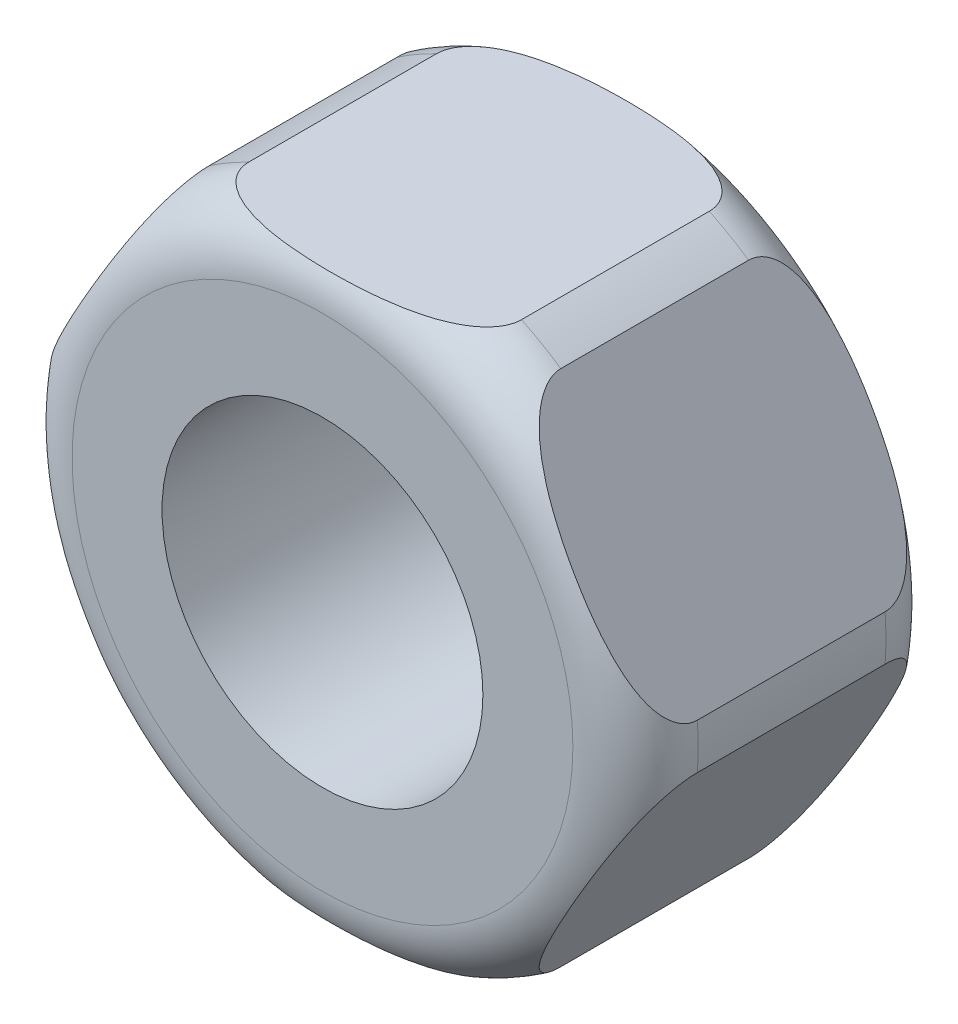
ISO-10303-21;
HEADER;
FILE_DESCRIPTION(('STEP AP214'),'2;1');
FILE_NAME('part.step','',(''),(''),'','','');
FILE_SCHEMA(('AUTOMOTIVE_DESIGN { 1 0 10303 214 1 1 1 1 }'));
ENDSEC;
DATA;
#1=APPLICATION_CONTEXT('core data for automotive mechanical design processes');
#2=APPLICATION_PROTOCOL_DEFINITION('international standard','automotive_design',2000,#1);
#3=PRODUCT_CONTEXT('',#1,'mechanical');
#4=PRODUCT('Part','Part','',(#3));
#5=PRODUCT_RELATED_PRODUCT_CATEGORY('part','',(#4));
#6=PRODUCT_DEFINITION_FORMATION('','',#4);
#7=PRODUCT_DEFINITION_CONTEXT('part definition',#1,'design');
#8=PRODUCT_DEFINITION('design','',#6,#7);
#9=PRODUCT_DEFINITION_SHAPE('','',#8);
#10=(LENGTH_UNIT() NAMED_UNIT(*) SI_UNIT(.MILLI.,.METRE.));
#11=(NAMED_UNIT(*) PLANE_ANGLE_UNIT() SI_UNIT($,.RADIAN.));
#12=(NAMED_UNIT(*) SI_UNIT($,.STERADIAN.) SOLID_ANGLE_UNIT());
#13=UNCERTAINTY_MEASURE_WITH_UNIT(LENGTH_MEASURE(1.E-05),#10,'distance_accuracy_value','');
#14=(GEOMETRIC_REPRESENTATION_CONTEXT(3) GLOBAL_UNCERTAINTY_ASSIGNED_CONTEXT((#13)) GLOBAL_UNIT_ASSIGNED_CONTEXT((#10,
#11,#12)) REPRESENTATION_CONTEXT('',''));
#15=CARTESIAN_POINT('',(0.,0.,0.));
#16=DIRECTION('',(0.,0.,1.));
#17=DIRECTION('',(1.,0.,0.));
#18=AXIS2_PLACEMENT_3D('',#15,#16,#17);
#19=CARTESIAN_POINT('',(0.,0.,10.));
#20=DIRECTION('',(0.,0.,-1.));
#21=DIRECTION('',(-1.,0.,0.));
#22=AXIS2_PLACEMENT_3D('',#19,#20,#21);
#23=CYLINDRICAL_SURFACE('',#22,10.);
#24=DIRECTION('',(0.,0.,-1.));
#25=VECTOR('',#24,1.);
#26=CARTESIAN_POINT('',(5.61477916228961,-8.27491721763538,10.));
#27=LINE('',#26,#25);
#28=CARTESIAN_POINT('',(5.61477916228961,-8.27491721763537,8.));
#29=VERTEX_POINT('',#28);
#30=CARTESIAN_POINT('',(5.61477916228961,-8.27491721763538,2.));
#31=VERTEX_POINT('',#30);
#32=EDGE_CURVE('E144',#29,#31,#27,.T.);
#33=ORIENTED_EDGE('',*,*,#32,.F.);
#34=CARTESIAN_POINT('',(0.,0.,8.));
#35=DIRECTION('',(0.,0.,1.));
#36=DIRECTION('',(1.,0.,0.));
#37=AXIS2_PLACEMENT_3D('',#34,#35,#36);
#38=CIRCLE('',#37,10.);
#39=CARTESIAN_POINT('',(4.35889894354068,-9.,8.));
#40=VERTEX_POINT('',#39);
#41=EDGE_CURVE('E141',#29,#40,#38,.F.);
#42=ORIENTED_EDGE('',*,*,#41,.T.);
#43=DIRECTION('',(0.,0.,-1.));
#44=VECTOR('',#43,1.);
#45=CARTESIAN_POINT('',(4.35889894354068,-9.,10.));
#46=LINE('',#45,#44);
#47=CARTESIAN_POINT('',(4.35889894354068,-9.,2.));
#48=VERTEX_POINT('',#47);
#49=EDGE_CURVE('E278',#48,#40,#46,.F.);
#50=ORIENTED_EDGE('',*,*,#49,.F.);
#51=CARTESIAN_POINT('',(0.,0.,2.));
#52=DIRECTION('',(0.,0.,1.));
#53=DIRECTION('',(1.,0.,0.));
#54=AXIS2_PLACEMENT_3D('',#51,#52,#53);
#55=CIRCLE('',#54,10.);
#56=EDGE_CURVE('E152',#48,#31,#55,.T.);
#57=ORIENTED_EDGE('',*,*,#56,.T.);
#58=EDGE_LOOP('',(#33,#42,#50,#57));
#59=FACE_BOUND('',#58,.T.);
#60=ADVANCED_FACE('F24',(#59),#23,.T.);
#61=DIRECTION('',(0.,0.,-1.));
#62=VECTOR('',#61,1.);
#63=CARTESIAN_POINT('',(9.97367810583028,-0.725082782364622,10.));
#64=LINE('',#63,#62);
#65=CARTESIAN_POINT('',(9.97367810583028,-0.725082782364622,2.));
#66=VERTEX_POINT('',#65);
#67=CARTESIAN_POINT('',(9.97367810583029,-0.725082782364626,8.));
#68=VERTEX_POINT('',#67);
#69=EDGE_CURVE('E250',#66,#68,#64,.F.);
#70=ORIENTED_EDGE('',*,*,#69,.F.);
#71=CARTESIAN_POINT('',(9.97367810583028,0.725082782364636,2.));
#72=VERTEX_POINT('',#71);
#73=EDGE_CURVE('E133',#66,#72,#55,.T.);
#74=ORIENTED_EDGE('',*,*,#73,.T.);
#75=DIRECTION('',(0.,0.,-1.));
#76=VECTOR('',#75,1.);
#77=CARTESIAN_POINT('',(9.97367810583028,0.725082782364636,10.));
#78=LINE('',#77,#76);
#79=CARTESIAN_POINT('',(9.97367810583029,0.725082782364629,8.));
#80=VERTEX_POINT('',#79);
#81=EDGE_CURVE('E117',#80,#72,#78,.T.);
#82=ORIENTED_EDGE('',*,*,#81,.F.);
#83=EDGE_CURVE('E131',#80,#68,#38,.F.);
#84=ORIENTED_EDGE('',*,*,#83,.T.);
#85=EDGE_LOOP('',(#70,#74,#82,#84));
#86=FACE_BOUND('',#85,.T.);
#87=ADVANCED_FACE('F130',(#86),#23,.T.);
#88=DIRECTION('',(0.,0.,-1.));
#89=VECTOR('',#88,1.);
#90=CARTESIAN_POINT('',(-4.35889894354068,-9.,10.));
#91=LINE('',#90,#89);
#92=CARTESIAN_POINT('',(-4.35889894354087,-9.,7.99999999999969));
#93=VERTEX_POINT('',#92);
#94=CARTESIAN_POINT('',(-4.35889894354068,-9.,2.));
#95=VERTEX_POINT('',#94);
#96=EDGE_CURVE('E251',#93,#95,#91,.T.);
#97=ORIENTED_EDGE('',*,*,#96,.F.);
#98=CARTESIAN_POINT('',(-5.6147791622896,-8.27491721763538,8.));
#99=VERTEX_POINT('',#98);
#100=EDGE_CURVE('E148',#93,#99,#38,.F.);
#101=ORIENTED_EDGE('',*,*,#100,.T.);
#102=DIRECTION('',(0.,0.,-1.));
#103=VECTOR('',#102,1.);
#104=CARTESIAN_POINT('',(-5.6147791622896,-8.27491721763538,10.));
#105=LINE('',#104,#103);
#106=CARTESIAN_POINT('',(-5.6147791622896,-8.27491721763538,2.));
#107=VERTEX_POINT('',#106);
#108=EDGE_CURVE('E273',#107,#99,#105,.F.);
#109=ORIENTED_EDGE('',*,*,#108,.F.);
#110=EDGE_CURVE('E284',#107,#95,#55,.T.);
#111=ORIENTED_EDGE('',*,*,#110,.T.);
#112=EDGE_LOOP('',(#97,#101,#109,#111));
#113=FACE_BOUND('',#112,.T.);
#114=ADVANCED_FACE('F304',(#113),#23,.T.);
#115=DIRECTION('',(0.,0.,-1.));
#116=VECTOR('',#115,1.);
#117=CARTESIAN_POINT('',(-9.97367810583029,-0.725082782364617,10.));
#118=LINE('',#117,#116);
#119=CARTESIAN_POINT('',(-9.97367810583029,-0.725082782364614,8.));
#120=VERTEX_POINT('',#119);
#121=CARTESIAN_POINT('',(-9.97367810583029,-0.725082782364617,2.));
#122=VERTEX_POINT('',#121);
#123=EDGE_CURVE('E271',#120,#122,#118,.T.);
#124=ORIENTED_EDGE('',*,*,#123,.F.);
#125=CARTESIAN_POINT('',(-9.97367810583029,0.72508278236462,8.));
#126=VERTEX_POINT('',#125);
#127=EDGE_CURVE('E155',#120,#126,#38,.F.);
#128=ORIENTED_EDGE('',*,*,#127,.T.);
#129=DIRECTION('',(0.,0.,-1.));
#130=VECTOR('',#129,1.);
#131=CARTESIAN_POINT('',(-9.97367810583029,0.725082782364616,10.));
#132=LINE('',#131,#130);
#133=CARTESIAN_POINT('',(-9.97367810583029,0.725082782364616,2.));
#134=VERTEX_POINT('',#133);
#135=EDGE_CURVE('E209',#134,#126,#132,.F.);
#136=ORIENTED_EDGE('',*,*,#135,.F.);
#137=EDGE_CURVE('E277',#134,#122,#55,.T.);
#138=ORIENTED_EDGE('',*,*,#137,.T.);
#139=EDGE_LOOP('',(#124,#128,#136,#138));
#140=FACE_BOUND('',#139,.T.);
#141=ADVANCED_FACE('F275',(#140),#23,.T.);
#142=DIRECTION('',(0.,0.,-1.));
#143=VECTOR('',#142,1.);
#144=CARTESIAN_POINT('',(-5.6147791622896,8.27491721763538,10.));
#145=LINE('',#144,#143);
#146=CARTESIAN_POINT('',(-5.61477916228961,8.27491721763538,8.));
#147=VERTEX_POINT('',#146);
#148=CARTESIAN_POINT('',(-5.6147791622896,8.27491721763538,2.));
#149=VERTEX_POINT('',#148);
#150=EDGE_CURVE('E172',#147,#149,#145,.T.);
#151=ORIENTED_EDGE('',*,*,#150,.F.);
#152=CARTESIAN_POINT('',(-4.35889894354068,9.,8.));
#153=VERTEX_POINT('',#152);
#154=EDGE_CURVE('E142',#147,#153,#38,.F.);
#155=ORIENTED_EDGE('',*,*,#154,.T.);
#156=DIRECTION('',(0.,0.,-1.));
#157=VECTOR('',#156,1.);
#158=CARTESIAN_POINT('',(-4.35889894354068,9.,10.));
#159=LINE('',#158,#157);
#160=CARTESIAN_POINT('',(-4.35889894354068,9.,2.));
#161=VERTEX_POINT('',#160);
#162=EDGE_CURVE('E51',#161,#153,#159,.F.);
#163=ORIENTED_EDGE('',*,*,#162,.F.);
#164=EDGE_CURVE('E283',#161,#149,#55,.T.);
#165=ORIENTED_EDGE('',*,*,#164,.T.);
#166=EDGE_LOOP('',(#151,#155,#163,#165));
#167=FACE_BOUND('',#166,.T.);
#168=ADVANCED_FACE('F169',(#167),#23,.T.);
#169=DIRECTION('',(0.,0.,-1.));
#170=VECTOR('',#169,1.);
#171=CARTESIAN_POINT('',(4.35889894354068,9.,10.));
#172=LINE('',#171,#170);
#173=CARTESIAN_POINT('',(4.35889894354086,9.,7.99999999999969));
#174=VERTEX_POINT('',#173);
#175=CARTESIAN_POINT('',(4.35889894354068,9.,2.));
#176=VERTEX_POINT('',#175);
#177=EDGE_CURVE('E210',#174,#176,#172,.T.);
#178=ORIENTED_EDGE('',*,*,#177,.F.);
#179=CARTESIAN_POINT('',(5.61477916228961,8.27491721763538,8.));
#180=VERTEX_POINT('',#179);
#181=EDGE_CURVE('E138',#174,#180,#38,.F.);
#182=ORIENTED_EDGE('',*,*,#181,.T.);
#183=DIRECTION('',(0.,0.,-1.));
#184=VECTOR('',#183,1.);
#185=CARTESIAN_POINT('',(5.61477916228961,8.27491721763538,10.));
#186=LINE('',#185,#184);
#187=CARTESIAN_POINT('',(5.61477916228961,8.27491721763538,2.));
#188=VERTEX_POINT('',#187);
#189=EDGE_CURVE('E43',#188,#180,#186,.F.);
#190=ORIENTED_EDGE('',*,*,#189,.F.);
#191=EDGE_CURVE('E153',#188,#176,#55,.T.);
#192=ORIENTED_EDGE('',*,*,#191,.T.);
#193=EDGE_LOOP('',(#178,#182,#190,#192));
#194=FACE_BOUND('',#193,.T.);
#195=ADVANCED_FACE('F217',(#194),#23,.T.);
#196=CARTESIAN_POINT('',(0.,0.,2.));
#197=DIRECTION('',(0.,0.,1.));
#198=DIRECTION('',(1.,0.,0.));
#199=AXIS2_PLACEMENT_3D('',#196,#197,#198);
#200=TOROIDAL_SURFACE('',#199,8.,2.);
#201=CARTESIAN_POINT('',(0.,0.,0.));
#202=DIRECTION('',(0.,0.,1.));
#203=DIRECTION('',(1.,0.,0.));
#204=AXIS2_PLACEMENT_3D('',#201,#202,#203);
#205=CIRCLE('',#204,8.);
#206=CARTESIAN_POINT('',(8.,0.,0.));
#207=VERTEX_POINT('',#206);
#208=EDGE_CURVE('E287',#207,#207,#205,.F.);
#209=ORIENTED_EDGE('',*,*,#208,.F.);
#210=EDGE_LOOP('',(#209));
#211=FACE_BOUND('',#210,.T.);
#212=ORIENTED_EDGE('',*,*,#73,.F.);
#213=CARTESIAN_POINT('',(9.9736780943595,-0.725082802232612,2.0002));
#214=CARTESIAN_POINT('',(9.97368389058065,-0.725072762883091,1.97391380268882));
#215=CARTESIAN_POINT('',(9.97308917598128,-0.726102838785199,1.94764211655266));
#216=CARTESIAN_POINT('',(9.97072898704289,-0.730190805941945,1.89533056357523));
#217=CARTESIAN_POINT('',(9.96896445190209,-0.733247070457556,1.86929052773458));
#218=CARTESIAN_POINT('',(9.96200368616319,-0.745303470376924,1.79224210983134));
#219=CARTESIAN_POINT('',(9.95513909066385,-0.75719329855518,1.7418069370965));
#220=CARTESIAN_POINT('',(9.93752240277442,-0.787706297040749,1.64397779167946));
#221=CARTESIAN_POINT('',(9.92678159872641,-0.806309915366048,1.59657545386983));
#222=CARTESIAN_POINT('',(9.90207636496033,-0.849100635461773,1.50517510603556));
#223=CARTESIAN_POINT('',(9.88810449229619,-0.873300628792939,1.46118527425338));
#224=CARTESIAN_POINT('',(9.84760089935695,-0.943454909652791,1.34927605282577));
#225=CARTESIAN_POINT('',(9.81884230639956,-0.993266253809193,1.28458803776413));
#226=CARTESIAN_POINT('',(9.75669817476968,-1.10090304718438,1.16483855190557));
#227=CARTESIAN_POINT('',(9.72330037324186,-1.15874973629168,1.10980349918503));
#228=CARTESIAN_POINT('',(9.65790364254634,-1.27202019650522,1.01464721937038));
#229=CARTESIAN_POINT('',(9.62626373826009,-1.32682211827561,0.97351986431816));
#230=CARTESIAN_POINT('',(9.56132177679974,-1.43930489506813,0.896839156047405));
#231=CARTESIAN_POINT('',(9.52801838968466,-1.49698805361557,0.861290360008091));
#232=CARTESIAN_POINT('',(9.46018528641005,-1.61447843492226,0.794983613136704));
#233=CARTESIAN_POINT('',(9.42565365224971,-1.67428897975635,0.764233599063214));
#234=CARTESIAN_POINT('',(9.35574989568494,-1.79536583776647,0.706946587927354));
#235=CARTESIAN_POINT('',(9.32037805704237,-1.85663165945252,0.680408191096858));
#236=CARTESIAN_POINT('',(9.23436700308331,-2.00560717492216,0.620826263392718));
#237=CARTESIAN_POINT('',(9.18341743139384,-2.0938544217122,0.589580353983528));
#238=CARTESIAN_POINT('',(9.08068924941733,-2.27178485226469,0.533043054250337));
#239=CARTESIAN_POINT('',(9.02891024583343,-2.3614687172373,0.507754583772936));
#240=CARTESIAN_POINT('',(8.92472412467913,-2.54192437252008,0.462112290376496));
#241=CARTESIAN_POINT('',(8.87231607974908,-2.63269776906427,0.441767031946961));
#242=CARTESIAN_POINT('',(8.76713199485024,-2.8148819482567,0.405279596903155));
#243=CARTESIAN_POINT('',(8.71435588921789,-2.90629284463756,0.389138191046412));
#244=CARTESIAN_POINT('',(8.55500188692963,-3.18230207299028,0.345865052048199));
#245=CARTESIAN_POINT('',(8.44805516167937,-3.36753923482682,0.324153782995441));
#246=CARTESIAN_POINT('',(8.23389090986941,-3.73848260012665,0.291618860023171));
#247=CARTESIAN_POINT('',(8.1266737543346,-3.92418816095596,0.280784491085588));
#248=CARTESIAN_POINT('',(7.9060418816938,-4.3063337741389,0.267857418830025));
#249=CARTESIAN_POINT('',(7.7926196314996,-4.50278687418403,0.266293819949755));
#250=CARTESIAN_POINT('',(7.56576903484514,-4.89570363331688,0.273006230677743));
#251=CARTESIAN_POINT('',(7.45234072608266,-5.0921672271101,0.281288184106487));
#252=CARTESIAN_POINT('',(7.28287720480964,-5.3856866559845,0.302229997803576));
#253=CARTESIAN_POINT('',(7.226706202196,-5.4829776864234,0.310584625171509));
#254=CARTESIAN_POINT('',(7.11450813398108,-5.67731044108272,0.330500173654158));
#255=CARTESIAN_POINT('',(7.05848105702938,-5.77435218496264,0.342060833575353));
#256=CARTESIAN_POINT('',(6.94669204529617,-5.96797643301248,0.368872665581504));
#257=CARTESIAN_POINT('',(6.8909299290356,-6.06455925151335,0.38412076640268));
#258=CARTESIAN_POINT('',(6.77975134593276,-6.25712620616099,0.418969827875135));
#259=CARTESIAN_POINT('',(6.72433482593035,-6.35311043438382,0.438570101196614));
#260=CARTESIAN_POINT('',(6.60373106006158,-6.56200228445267,0.487103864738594));
#261=CARTESIAN_POINT('',(6.53864810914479,-6.67472926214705,0.517096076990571));
#262=CARTESIAN_POINT('',(6.40937020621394,-6.89864515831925,0.58639840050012));
#263=CARTESIAN_POINT('',(6.3451807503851,-7.009824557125,0.62575094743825));
#264=CARTESIAN_POINT('',(6.24094100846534,-7.19037308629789,0.700440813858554));
#265=CARTESIAN_POINT('',(6.20028564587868,-7.26079023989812,0.732384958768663));
#266=CARTESIAN_POINT('',(6.12021514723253,-7.39947641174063,0.802211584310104));
#267=CARTESIAN_POINT('',(6.08080092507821,-7.46774384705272,0.840098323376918));
#268=CARTESIAN_POINT('',(6.00408189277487,-7.60062510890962,0.922611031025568));
#269=CARTESIAN_POINT('',(5.96676506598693,-7.66525974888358,0.967191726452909));
#270=CARTESIAN_POINT('',(5.89491273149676,-7.78971164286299,1.0644622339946));
#271=CARTESIAN_POINT('',(5.86037172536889,-7.84953842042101,1.11713538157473));
#272=CARTESIAN_POINT('',(5.80377139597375,-7.94757306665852,1.21716952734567));
#273=CARTESIAN_POINT('',(5.78078564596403,-7.98738555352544,1.26241687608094));
#274=CARTESIAN_POINT('',(5.73791841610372,-8.06163377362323,1.35860411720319));
#275=CARTESIAN_POINT('',(5.7180388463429,-8.09606619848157,1.40954747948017));
#276=CARTESIAN_POINT('',(5.68229428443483,-8.15797759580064,1.51782764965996));
#277=CARTESIAN_POINT('',(5.6664836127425,-8.18536248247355,1.57523758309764));
#278=CARTESIAN_POINT('',(5.6406446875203,-8.23011681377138,1.69498684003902));
#279=CARTESIAN_POINT('',(5.63059519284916,-8.24752304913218,1.75730707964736));
#280=CARTESIAN_POINT('',(5.62095593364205,-8.26421873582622,1.85042399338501));
#281=CARTESIAN_POINT('',(5.61864748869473,-8.26821707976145,1.88015343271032));
#282=CARTESIAN_POINT('',(5.61555396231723,-8.27357522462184,1.93998012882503));
#283=CARTESIAN_POINT('',(5.61477160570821,-8.2749303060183,1.97007794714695));
#284=CARTESIAN_POINT('',(5.6147791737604,-8.27491719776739,2.0002));
#285=B_SPLINE_CURVE_WITH_KNOTS('',3,(#213,#214,#215,#216,#217,#218,#219,#220,#221,#222,#223,
#224,#225,#226,#227,#228,#229,#230,#231,#232,#233,#234,#235,#236,#237,#238,#239,#240,#241,#242,
#243,#244,#245,#246,#247,#248,#249,#250,#251,#252,#253,#254,#255,#256,#257,#258,#259,#260,#261,
#262,#263,#264,#265,#266,#267,#268,#269,#270,#271,#272,#273,#274,#275,#276,#277,#278,#279,#280,
#281,#282,#283,#284),.UNSPECIFIED.,.F.,.F.,(4,2,2,2,2,2,2,2,2,2,2,2,2,2,2,2,2,2,2,2,2,2,2,2,2,2,
2,2,2,2,2,2,2,2,2,4),(0.,0.0788036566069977,0.157544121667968,0.313550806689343,
0.469106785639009,0.625024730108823,0.883219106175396,1.142109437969,1.36819357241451,
1.59446144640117,1.82109966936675,2.04766240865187,2.36716963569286,2.68683313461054,
3.007046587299,3.32731870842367,3.97187679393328,4.61579928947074,5.29614309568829,
5.97689783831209,6.31481869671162,6.65271203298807,6.9903249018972,7.32788449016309,
7.72836870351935,8.13070435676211,8.39260240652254,8.65468899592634,8.91507682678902,
9.17493546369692,9.36801206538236,9.56120693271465,9.7568608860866,9.95178875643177,
10.0419074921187,10.1321869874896),.UNSPECIFIED.);
#286=EDGE_CURVE('E139',#66,#31,#285,.T.);
#287=ORIENTED_EDGE('',*,*,#286,.T.);
#288=ORIENTED_EDGE('',*,*,#56,.F.);
#289=CARTESIAN_POINT('',(0.,-9.,0.26794919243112));
#290=CARTESIAN_POINT('',(-0.157518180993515,-9.,0.267951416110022));
#291=CARTESIAN_POINT('',(-0.315034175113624,-9.,0.270319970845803));
#292=CARTESIAN_POINT('',(-0.629939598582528,-9.,0.280008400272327));
#293=CARTESIAN_POINT('',(-0.787329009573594,-9.,0.287328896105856));
#294=CARTESIAN_POINT('',(-1.10226799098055,-9.,0.30759064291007));
#295=CARTESIAN_POINT('',(-1.2598164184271,-9.,0.32055009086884));
#296=CARTESIAN_POINT('',(-1.5742025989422,-9.,0.353207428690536));
#297=CARTESIAN_POINT('',(-1.731040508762,-9.,0.372903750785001));
#298=CARTESIAN_POINT('',(-2.01193908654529,-9.,0.415905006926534));
#299=CARTESIAN_POINT('',(-2.13623092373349,-9.,0.437681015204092));
#300=CARTESIAN_POINT('',(-2.38347588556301,-9.,0.487790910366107));
#301=CARTESIAN_POINT('',(-2.50642940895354,-9.,0.51612278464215));
#302=CARTESIAN_POINT('',(-2.74964185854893,-9.,0.58075089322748));
#303=CARTESIAN_POINT('',(-2.86991073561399,-9.,0.61700905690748));
#304=CARTESIAN_POINT('',(-3.10689952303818,-9.,0.69956133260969));
#305=CARTESIAN_POINT('',(-3.22362375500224,-9.,0.745842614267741));
#306=CARTESIAN_POINT('',(-3.41423573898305,-9.,0.834044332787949));
#307=CARTESIAN_POINT('',(-3.48971859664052,-9.,0.872495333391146));
#308=CARTESIAN_POINT('',(-3.63691833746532,-9.,0.956333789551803));
#309=CARTESIAN_POINT('',(-3.70863066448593,-9.,1.0017293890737));
#310=CARTESIAN_POINT('',(-3.84691482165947,-9.,1.1010294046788));
#311=CARTESIAN_POINT('',(-3.91343851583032,-9.,1.15500196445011));
#312=CARTESIAN_POINT('',(-4.03762483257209,-9.,1.27238390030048));
#313=CARTESIAN_POINT('',(-4.09530609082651,-9.,1.33577285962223));
#314=CARTESIAN_POINT('',(-4.18069063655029,-9.,1.45025965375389));
#315=CARTESIAN_POINT('',(-4.21203560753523,-9.,1.49862386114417));
#316=CARTESIAN_POINT('',(-4.26688325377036,-9.,1.59965232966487));
#317=CARTESIAN_POINT('',(-4.29039184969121,-9.,1.65231330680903));
#318=CARTESIAN_POINT('',(-4.32789907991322,-9.,1.76157976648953));
#319=CARTESIAN_POINT('',(-4.3418008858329,-9.,1.81821924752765));
#320=CARTESIAN_POINT('',(-4.35823396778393,-9.,1.9331226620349));
#321=CARTESIAN_POINT('',(-4.36077556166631,-9.,1.99138507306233));
#322=CARTESIAN_POINT('',(-4.35465277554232,-9.,2.09979278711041));
#323=CARTESIAN_POINT('',(-4.34738028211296,-9.,2.15002304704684));
#324=CARTESIAN_POINT('',(-4.32464311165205,-9.,2.24858067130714));
#325=CARTESIAN_POINT('',(-4.30917476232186,-9.,2.29690717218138));
#326=CARTESIAN_POINT('',(-4.26594452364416,-9.,2.40351170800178));
#327=CARTESIAN_POINT('',(-4.23597579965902,-9.,2.4608895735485));
#328=CARTESIAN_POINT('',(-4.16717066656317,-9.,2.57004050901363));
#329=CARTESIAN_POINT('',(-4.12831704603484,-9.,2.62180240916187));
#330=CARTESIAN_POINT('',(-4.02250016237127,-9.,2.74470029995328));
#331=CARTESIAN_POINT('',(-3.95133057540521,-9.,2.81218511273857));
#332=CARTESIAN_POINT('',(-3.79973103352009,-9.,2.93563701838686));
#333=CARTESIAN_POINT('',(-3.71928251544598,-9.,2.99158037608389));
#334=CARTESIAN_POINT('',(-3.55888152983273,-9.,3.08991508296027));
#335=CARTESIAN_POINT('',(-3.47935340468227,-9.,3.13301212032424));
#336=CARTESIAN_POINT('',(-3.31688787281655,-9.,3.21230188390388));
#337=CARTESIAN_POINT('',(-3.23394743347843,-9.,3.24848829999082));
#338=CARTESIAN_POINT('',(-3.06553332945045,-9.,3.31512482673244));
#339=CARTESIAN_POINT('',(-2.98005276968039,-9.,3.34555728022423));
#340=CARTESIAN_POINT('',(-2.80754144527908,-9.,3.40144654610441));
#341=CARTESIAN_POINT('',(-2.72051134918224,-9.,3.42690545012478));
#342=CARTESIAN_POINT('',(-2.49785685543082,-9.,3.48627998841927));
#343=CARTESIAN_POINT('',(-2.36146277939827,-9.,3.51729937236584));
#344=CARTESIAN_POINT('',(-2.08709344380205,-9.,3.57146164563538));
#345=CARTESIAN_POINT('',(-1.94911734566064,-9.,3.59460013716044));
#346=CARTESIAN_POINT('',(-1.6719629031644,-9.,3.63456257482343));
#347=CARTESIAN_POINT('',(-1.53278259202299,-9.,3.65137262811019));
#348=CARTESIAN_POINT('',(-1.25392862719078,-9.,3.67973280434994));
#349=CARTESIAN_POINT('',(-1.11425507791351,-9.,3.69128398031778));
#350=CARTESIAN_POINT('',(-0.834299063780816,-9.,3.70993582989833));
#351=CARTESIAN_POINT('',(-0.694015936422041,-9.,3.71702633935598));
#352=CARTESIAN_POINT('',(-0.413299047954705,-9.,3.72720540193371));
#353=CARTESIAN_POINT('',(-0.272865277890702,-9.,3.73029370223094));
#354=CARTESIAN_POINT('',(0.00785428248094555,-9.,3.73268091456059));
#355=CARTESIAN_POINT('',(0.148140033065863,-9.,3.73198465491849));
#356=CARTESIAN_POINT('',(0.428631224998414,-9.,3.72676676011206));
#357=CARTESIAN_POINT('',(0.568836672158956,-9.,3.72224545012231));
#358=CARTESIAN_POINT('',(0.823094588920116,-9.,3.71028150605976));
#359=CARTESIAN_POINT('',(0.937179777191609,-9.,3.70353531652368));
#360=CARTESIAN_POINT('',(1.16514437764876,-9.,3.68698195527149));
#361=CARTESIAN_POINT('',(1.27902376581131,-9.,3.67717444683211));
#362=CARTESIAN_POINT('',(1.50626128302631,-9.,3.65407599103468));
#363=CARTESIAN_POINT('',(1.61961993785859,-9.,3.64079029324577));
#364=CARTESIAN_POINT('',(1.84578344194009,-9.,3.61013913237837));
#365=CARTESIAN_POINT('',(1.95858833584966,-9.,3.59277400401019));
#366=CARTESIAN_POINT('',(2.18417105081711,-9.,3.55305136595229));
#367=CARTESIAN_POINT('',(2.2969427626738,-9.,3.53065862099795));
#368=CARTESIAN_POINT('',(2.52120825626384,-9.,3.47993136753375));
#369=CARTESIAN_POINT('',(2.63270157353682,-9.,3.45159476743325));
#370=CARTESIAN_POINT('',(2.85386543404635,-9.,3.38760902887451));
#371=CARTESIAN_POINT('',(2.96353143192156,-9.,3.35194395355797));
#372=CARTESIAN_POINT('',(3.17952284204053,-9.,3.27165981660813));
#373=CARTESIAN_POINT('',(3.285851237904,-9.,3.22704903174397));
#374=CARTESIAN_POINT('',(3.4531664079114,-9.,3.14601188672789));
#375=CARTESIAN_POINT('',(3.51583219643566,-9.,3.11305911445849));
#376=CARTESIAN_POINT('',(3.63843025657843,-9.,3.04226829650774));
#377=CARTESIAN_POINT('',(3.6983608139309,-9.,3.00442724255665));
#378=CARTESIAN_POINT('',(3.81391767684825,-9.,2.92349840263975));
#379=CARTESIAN_POINT('',(3.86957388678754,-9.,2.88045380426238));
#380=CARTESIAN_POINT('',(3.9755225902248,-9.,2.78822690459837));
#381=CARTESIAN_POINT('',(4.02582227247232,-9.,2.7390530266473));
#382=CARTESIAN_POINT('',(4.11051371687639,-9.,2.64351857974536));
#383=CARTESIAN_POINT('',(4.14613692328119,-9.,2.59825992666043));
#384=CARTESIAN_POINT('',(4.21080936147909,-9.,2.50317568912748));
#385=CARTESIAN_POINT('',(4.2398571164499,-9.,2.45334908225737));
#386=CARTESIAN_POINT('',(4.28975119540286,-9.,2.34906449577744));
#387=CARTESIAN_POINT('',(4.31051456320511,-9.,2.29456600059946));
#388=CARTESIAN_POINT('',(4.34153868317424,-9.,2.18265718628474));
#389=CARTESIAN_POINT('',(4.35181303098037,-9.,2.12525073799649));
#390=CARTESIAN_POINT('',(4.36040598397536,-9.,2.01426641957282));
#391=CARTESIAN_POINT('',(4.35963206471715,-9.,1.96075854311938));
#392=CARTESIAN_POINT('',(4.34839784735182,-9.,1.85477324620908));
#393=CARTESIAN_POINT('',(4.33793530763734,-9.,1.80229606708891));
#394=CARTESIAN_POINT('',(4.30925890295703,-9.,1.70327056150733));
#395=CARTESIAN_POINT('',(4.29159574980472,-9.,1.65655884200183));
#396=CARTESIAN_POINT('',(4.24982232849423,-9.,1.56614827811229));
#397=CARTESIAN_POINT('',(4.22570998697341,-9.,1.52245040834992));
#398=CARTESIAN_POINT('',(4.1564076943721,-9.,1.41353339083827));
#399=CARTESIAN_POINT('',(4.10718869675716,-9.,1.35088166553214));
#400=CARTESIAN_POINT('',(3.99957971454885,-9.,1.2340109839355));
#401=CARTESIAN_POINT('',(3.94116454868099,-9.,1.17981602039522));
#402=CARTESIAN_POINT('',(3.8279212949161,-9.,1.08710016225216));
#403=CARTESIAN_POINT('',(3.77399481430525,-9.,1.04745669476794));
#404=CARTESIAN_POINT('',(3.66290071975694,-9.,0.972972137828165));
#405=CARTESIAN_POINT('',(3.60573073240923,-9.,0.938134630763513));
#406=CARTESIAN_POINT('',(3.43050614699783,-9.,0.839854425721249));
#407=CARTESIAN_POINT('',(3.30888485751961,-9.,0.782757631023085));
#408=CARTESIAN_POINT('',(3.10368245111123,-9.,0.699253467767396));
#409=CARTESIAN_POINT('',(3.0215456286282,-9.,0.669071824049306));
#410=CARTESIAN_POINT('',(2.85566705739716,-9.,0.613461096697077));
#411=CARTESIAN_POINT('',(2.77192522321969,-9.,0.588032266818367));
#412=CARTESIAN_POINT('',(2.51876203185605,-9.,0.517728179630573));
#413=CARTESIAN_POINT('',(2.34765989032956,-9.,0.478933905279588));
#414=CARTESIAN_POINT('',(2.00271146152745,-9.,0.413269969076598));
#415=CARTESIAN_POINT('',(1.82885786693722,-9.,0.386440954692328));
#416=CARTESIAN_POINT('',(1.48014047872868,-9.,0.342087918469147));
#417=CARTESIAN_POINT('',(1.30527760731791,-9.,0.324556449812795));
#418=CARTESIAN_POINT('',(0.94191335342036,-9.,0.295861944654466));
#419=CARTESIAN_POINT('',(0.753368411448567,-9.,0.285272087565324));
#420=CARTESIAN_POINT('',(0.376547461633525,-9.,0.271324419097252));
#421=CARTESIAN_POINT('',(0.188272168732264,-9.,0.2679465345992));
#422=CARTESIAN_POINT('',(0.,-9.,0.26794919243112));
#423=B_SPLINE_CURVE_WITH_KNOTS('',3,(#289,#290,#291,#292,#293,#294,#295,#296,#297,#298,#299,
#300,#301,#302,#303,#304,#305,#306,#307,#308,#309,#310,#311,#312,#313,#314,#315,#316,#317,#318,
#319,#320,#321,#322,#323,#324,#325,#326,#327,#328,#329,#330,#331,#332,#333,#334,#335,#336,#337,
#338,#339,#340,#341,#342,#343,#344,#345,#346,#347,#348,#349,#350,#351,#352,#353,#354,#355,#356,
#357,#358,#359,#360,#361,#362,#363,#364,#365,#366,#367,#368,#369,#370,#371,#372,#373,#374,#375,
#376,#377,#378,#379,#380,#381,#382,#383,#384,#385,#386,#387,#388,#389,#390,#391,#392,#393,#394,
#395,#396,#397,#398,#399,#400,#401,#402,#403,#404,#405,#406,#407,#408,#409,#410,#411,#412,#413,
#414,#415,#416,#417,#418,#419,#420,#421,#422),.UNSPECIFIED.,.T.,.F.,(4,2,2,2,2,2,2,2,2,2,2,2,2,
2,2,2,2,2,2,2,2,2,2,2,2,2,2,2,2,2,2,2,2,2,2,2,2,2,2,2,2,2,2,2,2,2,2,2,2,2,2,2,2,2,2,2,2,2,2,2,2,
2,2,2,2,2,4),(0.,0.472532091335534,0.945123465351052,1.41925134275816,1.8932689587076,
2.27168684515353,2.64998871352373,3.02651199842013,3.40255612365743,3.65641148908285,
3.9105668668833,4.16685297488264,4.42259129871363,4.59492539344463,4.76712898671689,
4.94104388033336,5.11480078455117,5.26633057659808,5.41792832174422,5.61105219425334,
5.80455339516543,6.09713665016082,6.39031573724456,6.66127899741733,6.93248850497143,
7.20451722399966,7.4764312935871,7.89573541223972,8.31527313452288,8.73572657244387,
9.15609578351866,9.57741941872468,9.99876966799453,10.4195824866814,10.8403595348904,
11.1831776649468,11.5260335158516,11.8683748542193,12.2106881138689,12.5554797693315,
12.9003929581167,13.2460643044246,13.5914172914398,13.8036490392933,14.0160120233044,
14.2267200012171,14.4371415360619,14.6094748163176,14.7818467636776,14.9559038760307,
15.1297350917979,15.289376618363,15.4490550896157,15.5983076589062,15.7476082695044,
15.9852626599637,16.2235795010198,16.4240810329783,16.6247312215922,17.0265852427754,
17.2889964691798,17.5514217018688,18.0770936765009,18.6045380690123,19.131559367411,
19.6979274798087,20.2627171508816),.UNSPECIFIED.);
#424=EDGE_CURVE('E243',#48,#95,#423,.T.);
#425=ORIENTED_EDGE('',*,*,#424,.T.);
#426=ORIENTED_EDGE('',*,*,#110,.F.);
#427=CARTESIAN_POINT('',(-5.61477917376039,-8.2749171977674,2.0002));
#428=CARTESIAN_POINT('',(-5.61477337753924,-8.27492723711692,1.97391380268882));
#429=CARTESIAN_POINT('',(-5.61536809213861,-8.27389716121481,1.94764211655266));
#430=CARTESIAN_POINT('',(-5.617728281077,-8.26980919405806,1.89533056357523));
#431=CARTESIAN_POINT('',(-5.6194928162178,-8.26675292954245,1.86929052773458));
#432=CARTESIAN_POINT('',(-5.6264535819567,-8.25469652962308,1.79224210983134));
#433=CARTESIAN_POINT('',(-5.63331817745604,-8.24280670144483,1.7418069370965));
#434=CARTESIAN_POINT('',(-5.65093486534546,-8.21229370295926,1.64397779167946));
#435=CARTESIAN_POINT('',(-5.66167566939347,-8.19369008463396,1.59657545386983));
#436=CARTESIAN_POINT('',(-5.68638090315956,-8.15089936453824,1.50517510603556));
#437=CARTESIAN_POINT('',(-5.70035277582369,-8.12669937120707,1.46118527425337));
#438=CARTESIAN_POINT('',(-5.74085636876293,-8.05654509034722,1.34927605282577));
#439=CARTESIAN_POINT('',(-5.76961496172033,-8.00673374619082,1.28458803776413));
#440=CARTESIAN_POINT('',(-5.83175909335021,-7.89909695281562,1.16483855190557));
#441=CARTESIAN_POINT('',(-5.86515689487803,-7.84125026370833,1.10980349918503));
#442=CARTESIAN_POINT('',(-5.93055362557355,-7.72797980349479,1.01464721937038));
#443=CARTESIAN_POINT('',(-5.9621935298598,-7.6731778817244,0.973519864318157));
#444=CARTESIAN_POINT('',(-6.02713549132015,-7.56069510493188,0.896839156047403));
#445=CARTESIAN_POINT('',(-6.06043887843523,-7.50301194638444,0.861290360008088));
#446=CARTESIAN_POINT('',(-6.12827198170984,-7.38552156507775,0.794983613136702));
#447=CARTESIAN_POINT('',(-6.16280361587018,-7.32571102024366,0.764233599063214));
#448=CARTESIAN_POINT('',(-6.23270737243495,-7.20463416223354,0.706946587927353));
#449=CARTESIAN_POINT('',(-6.26807921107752,-7.14336834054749,0.680408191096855));
#450=CARTESIAN_POINT('',(-6.35409026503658,-6.99439282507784,0.620826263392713));
#451=CARTESIAN_POINT('',(-6.40503983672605,-6.90614557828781,0.589580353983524));
#452=CARTESIAN_POINT('',(-6.50776801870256,-6.72821514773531,0.533043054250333));
#453=CARTESIAN_POINT('',(-6.55954702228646,-6.63853128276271,0.507754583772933));
#454=CARTESIAN_POINT('',(-6.66373314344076,-6.45807562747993,0.462112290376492));
#455=CARTESIAN_POINT('',(-6.71614118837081,-6.36730223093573,0.441767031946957));
#456=CARTESIAN_POINT('',(-6.82132527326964,-6.18511805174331,0.405279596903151));
#457=CARTESIAN_POINT('',(-6.874101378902,-6.09370715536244,0.389138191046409));
#458=CARTESIAN_POINT('',(-7.03345538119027,-5.81769792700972,0.345865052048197));
#459=CARTESIAN_POINT('',(-7.14040210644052,-5.63246076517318,0.324153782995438));
#460=CARTESIAN_POINT('',(-7.35456635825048,-5.26151739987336,0.291618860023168));
#461=CARTESIAN_POINT('',(-7.46178351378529,-5.07581183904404,0.280784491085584));
#462=CARTESIAN_POINT('',(-7.6824153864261,-4.69366622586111,0.267857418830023));
#463=CARTESIAN_POINT('',(-7.79583763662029,-4.49721312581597,0.266293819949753));
#464=CARTESIAN_POINT('',(-8.02268823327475,-4.10429636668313,0.273006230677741));
#465=CARTESIAN_POINT('',(-8.13611654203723,-3.90783277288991,0.281288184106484));
#466=CARTESIAN_POINT('',(-8.30558006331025,-3.61431334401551,0.302229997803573));
#467=CARTESIAN_POINT('',(-8.36175106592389,-3.5170223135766,0.310584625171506));
#468=CARTESIAN_POINT('',(-8.47394913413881,-3.32268955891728,0.330500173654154));
#469=CARTESIAN_POINT('',(-8.52997621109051,-3.22564781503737,0.342060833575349));
#470=CARTESIAN_POINT('',(-8.64176522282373,-3.03202356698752,0.3688726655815));
#471=CARTESIAN_POINT('',(-8.69752733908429,-2.93544074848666,0.384120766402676));
#472=CARTESIAN_POINT('',(-8.80870592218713,-2.74287379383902,0.41896982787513));
#473=CARTESIAN_POINT('',(-8.86412244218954,-2.64688956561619,0.438570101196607));
#474=CARTESIAN_POINT('',(-8.98472620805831,-2.43799771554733,0.487103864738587));
#475=CARTESIAN_POINT('',(-9.0498091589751,-2.32527073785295,0.517096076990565));
#476=CARTESIAN_POINT('',(-9.17908706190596,-2.10135484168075,0.586398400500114));
#477=CARTESIAN_POINT('',(-9.24327651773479,-1.99017544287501,0.625750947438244));
#478=CARTESIAN_POINT('',(-9.34751625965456,-1.80962691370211,0.700440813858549));
#479=CARTESIAN_POINT('',(-9.38817162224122,-1.73920976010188,0.732384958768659));
#480=CARTESIAN_POINT('',(-9.46824212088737,-1.60052358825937,0.8022115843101));
#481=CARTESIAN_POINT('',(-9.50765634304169,-1.53225615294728,0.840098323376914));
#482=CARTESIAN_POINT('',(-9.58437537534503,-1.39937489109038,0.922611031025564));
#483=CARTESIAN_POINT('',(-9.62169220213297,-1.33474025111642,0.967191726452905));
#484=CARTESIAN_POINT('',(-9.69354453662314,-1.210288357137,1.0644622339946));
#485=CARTESIAN_POINT('',(-9.72808554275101,-1.15046157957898,1.11713538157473));
#486=CARTESIAN_POINT('',(-9.78468587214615,-1.05242693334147,1.21716952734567));
#487=CARTESIAN_POINT('',(-9.80767162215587,-1.01261444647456,1.26241687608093));
#488=CARTESIAN_POINT('',(-9.85053885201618,-0.938366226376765,1.35860411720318));
#489=CARTESIAN_POINT('',(-9.870418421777,-0.903933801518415,1.40954747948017));
#490=CARTESIAN_POINT('',(-9.90616298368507,-0.842022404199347,1.51782764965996));
#491=CARTESIAN_POINT('',(-9.9219736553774,-0.814637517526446,1.57523758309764));
#492=CARTESIAN_POINT('',(-9.9478125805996,-0.769883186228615,1.69498684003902));
#493=CARTESIAN_POINT('',(-9.95786207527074,-0.752476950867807,1.75730707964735));
#494=CARTESIAN_POINT('',(-9.96750133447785,-0.735781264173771,1.85042399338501));
#495=CARTESIAN_POINT('',(-9.96980977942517,-0.731782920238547,1.88015343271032));
#496=CARTESIAN_POINT('',(-9.97290330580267,-0.726424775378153,1.93998012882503));
#497=CARTESIAN_POINT('',(-9.97368566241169,-0.725069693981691,1.97007794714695));
#498=CARTESIAN_POINT('',(-9.9736780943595,-0.725082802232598,2.0002));
#499=B_SPLINE_CURVE_WITH_KNOTS('',3,(#427,#428,#429,#430,#431,#432,#433,#434,#435,#436,#437,
#438,#439,#440,#441,#442,#443,#444,#445,#446,#447,#448,#449,#450,#451,#452,#453,#454,#455,#456,
#457,#458,#459,#460,#461,#462,#463,#464,#465,#466,#467,#468,#469,#470,#471,#472,#473,#474,#475,
#476,#477,#478,#479,#480,#481,#482,#483,#484,#485,#486,#487,#488,#489,#490,#491,#492,#493,#494,
#495,#496,#497,#498),.UNSPECIFIED.,.F.,.F.,(4,2,2,2,2,2,2,2,2,2,2,2,2,2,2,2,2,2,2,2,2,2,2,2,2,2,
2,2,2,2,2,2,2,2,2,4),(0.,0.0788036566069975,0.157544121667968,0.313550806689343,
0.469106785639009,0.625024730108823,0.883219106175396,1.142109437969,1.36819357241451,
1.59446144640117,1.82109966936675,2.04766240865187,2.36716963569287,2.68683313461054,
3.007046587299,3.32731870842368,3.97187679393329,4.61579928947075,5.2961430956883,
5.9768978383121,6.31481869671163,6.65271203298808,6.99032490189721,7.32788449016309,
7.72836870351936,8.13070435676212,8.39260240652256,8.65468899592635,8.91507682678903,
9.17493546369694,9.36801206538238,9.56120693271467,9.75686088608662,9.95178875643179,
10.0419074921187,10.1321869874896),.UNSPECIFIED.);
#500=EDGE_CURVE('E236',#107,#122,#499,.T.);
#501=ORIENTED_EDGE('',*,*,#500,.T.);
#502=ORIENTED_EDGE('',*,*,#137,.F.);
#503=CARTESIAN_POINT('',(-9.9736780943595,0.725082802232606,2.0002));
#504=CARTESIAN_POINT('',(-9.97368389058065,0.725072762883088,1.97391380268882));
#505=CARTESIAN_POINT('',(-9.97308917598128,0.726102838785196,1.94764211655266));
#506=CARTESIAN_POINT('',(-9.97072898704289,0.73019080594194,1.89533056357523));
#507=CARTESIAN_POINT('',(-9.96896445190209,0.73324707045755,1.86929052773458));
#508=CARTESIAN_POINT('',(-9.96200368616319,0.745303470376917,1.79224210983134));
#509=CARTESIAN_POINT('',(-9.95513909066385,0.757193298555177,1.7418069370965));
#510=CARTESIAN_POINT('',(-9.93752240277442,0.787706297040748,1.64397779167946));
#511=CARTESIAN_POINT('',(-9.92678159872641,0.806309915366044,1.59657545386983));
#512=CARTESIAN_POINT('',(-9.90207636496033,0.849100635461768,1.50517510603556));
#513=CARTESIAN_POINT('',(-9.88810449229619,0.873300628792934,1.46118527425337));
#514=CARTESIAN_POINT('',(-9.84760089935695,0.943454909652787,1.34927605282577));
#515=CARTESIAN_POINT('',(-9.81884230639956,0.993266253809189,1.28458803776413));
#516=CARTESIAN_POINT('',(-9.75669817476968,1.10090304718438,1.16483855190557));
#517=CARTESIAN_POINT('',(-9.72330037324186,1.15874973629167,1.10980349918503));
#518=CARTESIAN_POINT('',(-9.65790364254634,1.27202019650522,1.01464721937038));
#519=CARTESIAN_POINT('',(-9.62626373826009,1.32682211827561,0.973519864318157));
#520=CARTESIAN_POINT('',(-9.56132177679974,1.43930489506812,0.896839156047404));
#521=CARTESIAN_POINT('',(-9.52801838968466,1.49698805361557,0.86129036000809));
#522=CARTESIAN_POINT('',(-9.46018528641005,1.61447843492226,0.794983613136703));
#523=CARTESIAN_POINT('',(-9.42565365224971,1.67428897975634,0.764233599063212));
#524=CARTESIAN_POINT('',(-9.35574989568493,1.79536583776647,0.706946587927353));
#525=CARTESIAN_POINT('',(-9.32037805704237,1.85663165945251,0.680408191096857));
#526=CARTESIAN_POINT('',(-9.23436700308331,2.00560717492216,0.620826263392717));
#527=CARTESIAN_POINT('',(-9.18341743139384,2.09385442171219,0.589580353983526));
#528=CARTESIAN_POINT('',(-9.08068924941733,2.27178485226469,0.533043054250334));
#529=CARTESIAN_POINT('',(-9.02891024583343,2.3614687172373,0.507754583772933));
#530=CARTESIAN_POINT('',(-8.92472412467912,2.54192437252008,0.462112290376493));
#531=CARTESIAN_POINT('',(-8.87231607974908,2.63269776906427,0.441767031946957));
#532=CARTESIAN_POINT('',(-8.76713199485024,2.8148819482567,0.405279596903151));
#533=CARTESIAN_POINT('',(-8.71435588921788,2.90629284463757,0.389138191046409));
#534=CARTESIAN_POINT('',(-8.55500188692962,3.18230207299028,0.345865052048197));
#535=CARTESIAN_POINT('',(-8.44805516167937,3.36753923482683,0.324153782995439));
#536=CARTESIAN_POINT('',(-8.23389090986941,3.73848260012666,0.291618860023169));
#537=CARTESIAN_POINT('',(-8.12667375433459,3.92418816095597,0.280784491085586));
#538=CARTESIAN_POINT('',(-7.90604188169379,4.30633377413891,0.267857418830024));
#539=CARTESIAN_POINT('',(-7.79261963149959,4.50278687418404,0.266293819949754));
#540=CARTESIAN_POINT('',(-7.56576903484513,4.89570363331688,0.273006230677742));
#541=CARTESIAN_POINT('',(-7.45234072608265,5.09216722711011,0.281288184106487));
#542=CARTESIAN_POINT('',(-7.28287720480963,5.38568665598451,0.302229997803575));
#543=CARTESIAN_POINT('',(-7.22670620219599,5.48297768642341,0.310584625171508));
#544=CARTESIAN_POINT('',(-7.11450813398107,5.67731044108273,0.330500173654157));
#545=CARTESIAN_POINT('',(-7.05848105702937,5.77435218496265,0.342060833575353));
#546=CARTESIAN_POINT('',(-6.94669204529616,5.96797643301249,0.368872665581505));
#547=CARTESIAN_POINT('',(-6.89092992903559,6.06455925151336,0.384120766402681));
#548=CARTESIAN_POINT('',(-6.77975134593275,6.257126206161,0.418969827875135));
#549=CARTESIAN_POINT('',(-6.72433482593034,6.35311043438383,0.438570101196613));
#550=CARTESIAN_POINT('',(-6.60373106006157,6.56200228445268,0.487103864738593));
#551=CARTESIAN_POINT('',(-6.53864810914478,6.67472926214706,0.51709607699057));
#552=CARTESIAN_POINT('',(-6.40937020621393,6.89864515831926,0.58639840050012));
#553=CARTESIAN_POINT('',(-6.34518075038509,7.00982455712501,0.625750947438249));
#554=CARTESIAN_POINT('',(-6.24094100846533,7.1903730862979,0.700440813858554));
#555=CARTESIAN_POINT('',(-6.20028564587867,7.26079023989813,0.732384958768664));
#556=CARTESIAN_POINT('',(-6.12021514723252,7.39947641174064,0.802211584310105));
#557=CARTESIAN_POINT('',(-6.0808009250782,7.46774384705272,0.840098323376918));
#558=CARTESIAN_POINT('',(-6.00408189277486,7.60062510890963,0.92261103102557));
#559=CARTESIAN_POINT('',(-5.96676506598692,7.66525974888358,0.967191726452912));
#560=CARTESIAN_POINT('',(-5.89491273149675,7.789711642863,1.06446223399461));
#561=CARTESIAN_POINT('',(-5.86037172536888,7.84953842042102,1.11713538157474));
#562=CARTESIAN_POINT('',(-5.80377139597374,7.94757306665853,1.21716952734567));
#563=CARTESIAN_POINT('',(-5.78078564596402,7.98738555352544,1.26241687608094));
#564=CARTESIAN_POINT('',(-5.73791841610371,8.06163377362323,1.35860411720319));
#565=CARTESIAN_POINT('',(-5.71803884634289,8.09606619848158,1.40954747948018));
#566=CARTESIAN_POINT('',(-5.68229428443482,8.15797759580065,1.51782764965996));
#567=CARTESIAN_POINT('',(-5.66648361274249,8.18536248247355,1.57523758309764));
#568=CARTESIAN_POINT('',(-5.64064468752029,8.23011681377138,1.69498684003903));
#569=CARTESIAN_POINT('',(-5.63059519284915,8.24752304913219,1.75730707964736));
#570=CARTESIAN_POINT('',(-5.62095593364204,8.26421873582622,1.85042399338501));
#571=CARTESIAN_POINT('',(-5.61864748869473,8.26821707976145,1.88015343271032));
#572=CARTESIAN_POINT('',(-5.61555396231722,8.27357522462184,1.93998012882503));
#573=CARTESIAN_POINT('',(-5.6147716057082,8.2749303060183,1.97007794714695));
#574=CARTESIAN_POINT('',(-5.61477917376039,8.27491719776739,2.0002));
#575=B_SPLINE_CURVE_WITH_KNOTS('',3,(#503,#504,#505,#506,#507,#508,#509,#510,#511,#512,#513,
#514,#515,#516,#517,#518,#519,#520,#521,#522,#523,#524,#525,#526,#527,#528,#529,#530,#531,#532,
#533,#534,#535,#536,#537,#538,#539,#540,#541,#542,#543,#544,#545,#546,#547,#548,#549,#550,#551,
#552,#553,#554,#555,#556,#557,#558,#559,#560,#561,#562,#563,#564,#565,#566,#567,#568,#569,#570,
#571,#572,#573,#574),.UNSPECIFIED.,.F.,.F.,(4,2,2,2,2,2,2,2,2,2,2,2,2,2,2,2,2,2,2,2,2,2,2,2,2,2,
2,2,2,2,2,2,2,2,2,4),(0.,0.0788036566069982,0.157544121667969,0.313550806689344,
0.469106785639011,0.625024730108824,0.883219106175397,1.142109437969,1.36819357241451,
1.59446144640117,1.82109966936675,2.04766240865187,2.36716963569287,2.68683313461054,
3.00704658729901,3.32731870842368,3.9718767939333,4.61579928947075,5.29614309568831,
5.97689783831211,6.31481869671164,6.65271203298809,6.99032490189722,7.32788449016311,
7.72836870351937,8.13070435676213,8.39260240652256,8.65468899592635,8.91507682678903,
9.17493546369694,9.36801206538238,9.56120693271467,9.75686088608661,9.95178875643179,
10.0419074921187,10.1321869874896),.UNSPECIFIED.);
#576=EDGE_CURVE('E230',#134,#149,#575,.T.);
#577=ORIENTED_EDGE('',*,*,#576,.T.);
#578=ORIENTED_EDGE('',*,*,#164,.F.);
#579=CARTESIAN_POINT('',(0.,9.,0.267949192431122));
#580=CARTESIAN_POINT('',(0.157518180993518,9.,0.267951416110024));
#581=CARTESIAN_POINT('',(0.315034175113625,9.,0.270319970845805));
#582=CARTESIAN_POINT('',(0.629939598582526,9.,0.280008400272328));
#583=CARTESIAN_POINT('',(0.787329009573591,9.,0.287328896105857));
#584=CARTESIAN_POINT('',(1.10226799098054,9.,0.307590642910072));
#585=CARTESIAN_POINT('',(1.25981641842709,9.,0.320550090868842));
#586=CARTESIAN_POINT('',(1.57420259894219,9.,0.353207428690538));
#587=CARTESIAN_POINT('',(1.73104050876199,9.,0.372903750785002));
#588=CARTESIAN_POINT('',(2.01193908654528,9.,0.415905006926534));
#589=CARTESIAN_POINT('',(2.13623092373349,9.,0.437681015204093));
#590=CARTESIAN_POINT('',(2.38347588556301,9.,0.487790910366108));
#591=CARTESIAN_POINT('',(2.50642940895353,9.,0.516122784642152));
#592=CARTESIAN_POINT('',(2.74964185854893,9.,0.580750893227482));
#593=CARTESIAN_POINT('',(2.86991073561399,9.,0.617009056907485));
#594=CARTESIAN_POINT('',(3.10689952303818,9.,0.699561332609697));
#595=CARTESIAN_POINT('',(3.22362375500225,9.,0.745842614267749));
#596=CARTESIAN_POINT('',(3.41423573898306,9.,0.834044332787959));
#597=CARTESIAN_POINT('',(3.48971859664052,9.,0.872495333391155));
#598=CARTESIAN_POINT('',(3.63691833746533,9.,0.95633378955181));
#599=CARTESIAN_POINT('',(3.70863066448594,9.,1.0017293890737));
#600=CARTESIAN_POINT('',(3.84691482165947,9.,1.1010294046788));
#601=CARTESIAN_POINT('',(3.91343851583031,9.,1.15500196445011));
#602=CARTESIAN_POINT('',(4.03762483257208,9.,1.27238390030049));
#603=CARTESIAN_POINT('',(4.0953060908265,9.,1.33577285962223));
#604=CARTESIAN_POINT('',(4.18069063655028,9.,1.45025965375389));
#605=CARTESIAN_POINT('',(4.21203560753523,9.,1.49862386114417));
#606=CARTESIAN_POINT('',(4.26688325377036,9.,1.59965232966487));
#607=CARTESIAN_POINT('',(4.2903918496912,9.,1.65231330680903));
#608=CARTESIAN_POINT('',(4.32789907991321,9.,1.76157976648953));
#609=CARTESIAN_POINT('',(4.34180088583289,9.,1.81821924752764));
#610=CARTESIAN_POINT('',(4.35823396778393,9.,1.93312266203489));
#611=CARTESIAN_POINT('',(4.3607755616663,9.,1.99138507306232));
#612=CARTESIAN_POINT('',(4.35465277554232,9.,2.0997927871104));
#613=CARTESIAN_POINT('',(4.34738028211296,9.,2.15002304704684));
#614=CARTESIAN_POINT('',(4.32464311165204,9.,2.24858067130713));
#615=CARTESIAN_POINT('',(4.30917476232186,9.,2.29690717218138));
#616=CARTESIAN_POINT('',(4.26594452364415,9.,2.40351170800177));
#617=CARTESIAN_POINT('',(4.23597579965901,9.,2.46088957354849));
#618=CARTESIAN_POINT('',(4.16717066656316,9.,2.57004050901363));
#619=CARTESIAN_POINT('',(4.12831704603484,9.,2.62180240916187));
#620=CARTESIAN_POINT('',(4.02250016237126,9.,2.74470029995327));
#621=CARTESIAN_POINT('',(3.9513305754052,9.,2.81218511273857));
#622=CARTESIAN_POINT('',(3.79973103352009,9.,2.93563701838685));
#623=CARTESIAN_POINT('',(3.71928251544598,9.,2.99158037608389));
#624=CARTESIAN_POINT('',(3.55888152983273,9.,3.08991508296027));
#625=CARTESIAN_POINT('',(3.47935340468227,9.,3.13301212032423));
#626=CARTESIAN_POINT('',(3.31688787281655,9.,3.21230188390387));
#627=CARTESIAN_POINT('',(3.23394743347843,9.,3.24848829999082));
#628=CARTESIAN_POINT('',(3.06553332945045,9.,3.31512482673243));
#629=CARTESIAN_POINT('',(2.9800527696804,9.,3.34555728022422));
#630=CARTESIAN_POINT('',(2.80754144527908,9.,3.40144654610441));
#631=CARTESIAN_POINT('',(2.72051134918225,9.,3.42690545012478));
#632=CARTESIAN_POINT('',(2.49785685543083,9.,3.48627998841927));
#633=CARTESIAN_POINT('',(2.36146277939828,9.,3.51729937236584));
#634=CARTESIAN_POINT('',(2.08709344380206,9.,3.57146164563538));
#635=CARTESIAN_POINT('',(1.94911734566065,9.,3.59460013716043));
#636=CARTESIAN_POINT('',(1.67196290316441,9.,3.63456257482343));
#637=CARTESIAN_POINT('',(1.532782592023,9.,3.65137262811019));
#638=CARTESIAN_POINT('',(1.2539286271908,9.,3.67973280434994));
#639=CARTESIAN_POINT('',(1.11425507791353,9.,3.69128398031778));
#640=CARTESIAN_POINT('',(0.834299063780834,9.,3.70993582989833));
#641=CARTESIAN_POINT('',(0.69401593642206,9.,3.71702633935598));
#642=CARTESIAN_POINT('',(0.413299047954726,9.,3.72720540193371));
#643=CARTESIAN_POINT('',(0.272865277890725,9.,3.73029370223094));
#644=CARTESIAN_POINT('',(-0.00785428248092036,9.,3.73268091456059));
#645=CARTESIAN_POINT('',(-0.148140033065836,9.,3.73198465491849));
#646=CARTESIAN_POINT('',(-0.428631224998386,9.,3.72676676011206));
#647=CARTESIAN_POINT('',(-0.568836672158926,9.,3.7222454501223));
#648=CARTESIAN_POINT('',(-0.823094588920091,9.,3.71028150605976));
#649=CARTESIAN_POINT('',(-0.937179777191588,9.,3.70353531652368));
#650=CARTESIAN_POINT('',(-1.16514437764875,9.,3.68698195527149));
#651=CARTESIAN_POINT('',(-1.2790237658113,9.,3.67717444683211));
#652=CARTESIAN_POINT('',(-1.50626128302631,9.,3.65407599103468));
#653=CARTESIAN_POINT('',(-1.6196199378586,9.,3.64079029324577));
#654=CARTESIAN_POINT('',(-1.84578344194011,9.,3.61013913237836));
#655=CARTESIAN_POINT('',(-1.95858833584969,9.,3.59277400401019));
#656=CARTESIAN_POINT('',(-2.18417105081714,9.,3.55305136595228));
#657=CARTESIAN_POINT('',(-2.29694276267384,9.,3.53065862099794));
#658=CARTESIAN_POINT('',(-2.52120825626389,9.,3.47993136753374));
#659=CARTESIAN_POINT('',(-2.63270157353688,9.,3.45159476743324));
#660=CARTESIAN_POINT('',(-2.85386543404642,9.,3.38760902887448));
#661=CARTESIAN_POINT('',(-2.96353143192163,9.,3.35194395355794));
#662=CARTESIAN_POINT('',(-3.17952284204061,9.,3.27165981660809));
#663=CARTESIAN_POINT('',(-3.28585123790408,9.,3.22704903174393));
#664=CARTESIAN_POINT('',(-3.45316640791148,9.,3.14601188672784));
#665=CARTESIAN_POINT('',(-3.51583219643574,9.,3.11305911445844));
#666=CARTESIAN_POINT('',(-3.6384302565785,9.,3.04226829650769));
#667=CARTESIAN_POINT('',(-3.69836081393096,9.,3.0044272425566));
#668=CARTESIAN_POINT('',(-3.81391767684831,9.,2.9234984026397));
#669=CARTESIAN_POINT('',(-3.86957388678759,9.,2.88045380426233));
#670=CARTESIAN_POINT('',(-3.97552259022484,9.,2.78822690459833));
#671=CARTESIAN_POINT('',(-4.02582227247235,9.,2.73905302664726));
#672=CARTESIAN_POINT('',(-4.11051371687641,9.,2.64351857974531));
#673=CARTESIAN_POINT('',(-4.14613692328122,9.,2.59825992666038));
#674=CARTESIAN_POINT('',(-4.2108093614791,9.,2.50317568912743));
#675=CARTESIAN_POINT('',(-4.23985711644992,9.,2.45334908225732));
#676=CARTESIAN_POINT('',(-4.28975119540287,9.,2.3490644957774));
#677=CARTESIAN_POINT('',(-4.31051456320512,9.,2.29456600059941));
#678=CARTESIAN_POINT('',(-4.34153868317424,9.,2.18265718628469));
#679=CARTESIAN_POINT('',(-4.35181303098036,9.,2.12525073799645));
#680=CARTESIAN_POINT('',(-4.36040598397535,9.,2.01426641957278));
#681=CARTESIAN_POINT('',(-4.35963206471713,9.,1.96075854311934));
#682=CARTESIAN_POINT('',(-4.34839784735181,9.,1.85477324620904));
#683=CARTESIAN_POINT('',(-4.33793530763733,9.,1.80229606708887));
#684=CARTESIAN_POINT('',(-4.30925890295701,9.,1.70327056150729));
#685=CARTESIAN_POINT('',(-4.2915957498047,9.,1.65655884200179));
#686=CARTESIAN_POINT('',(-4.24982232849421,9.,1.56614827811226));
#687=CARTESIAN_POINT('',(-4.22570998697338,9.,1.52245040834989));
#688=CARTESIAN_POINT('',(-4.15640769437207,9.,1.41353339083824));
#689=CARTESIAN_POINT('',(-4.10718869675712,9.,1.35088166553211));
#690=CARTESIAN_POINT('',(-3.99957971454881,9.,1.23401098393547));
#691=CARTESIAN_POINT('',(-3.94116454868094,9.,1.17981602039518));
#692=CARTESIAN_POINT('',(-3.82792129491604,9.,1.08710016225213));
#693=CARTESIAN_POINT('',(-3.77399481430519,9.,1.0474566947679));
#694=CARTESIAN_POINT('',(-3.66290071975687,9.,0.972972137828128));
#695=CARTESIAN_POINT('',(-3.60573073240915,9.,0.938134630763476));
#696=CARTESIAN_POINT('',(-3.43050614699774,9.,0.839854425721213));
#697=CARTESIAN_POINT('',(-3.30888485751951,9.,0.782757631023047));
#698=CARTESIAN_POINT('',(-3.10368245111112,9.,0.699253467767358));
#699=CARTESIAN_POINT('',(-3.02154562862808,9.,0.669071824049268));
#700=CARTESIAN_POINT('',(-2.85566705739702,9.,0.613461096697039));
#701=CARTESIAN_POINT('',(-2.77192522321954,9.,0.588032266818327));
#702=CARTESIAN_POINT('',(-2.51876203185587,9.,0.517728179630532));
#703=CARTESIAN_POINT('',(-2.34765989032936,9.,0.478933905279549));
#704=CARTESIAN_POINT('',(-2.00271146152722,9.,0.413269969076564));
#705=CARTESIAN_POINT('',(-1.82885786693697,9.,0.386440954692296));
#706=CARTESIAN_POINT('',(-1.48014047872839,9.,0.342087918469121));
#707=CARTESIAN_POINT('',(-1.30527760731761,9.,0.324556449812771));
#708=CARTESIAN_POINT('',(-0.941913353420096,9.,0.295861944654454));
#709=CARTESIAN_POINT('',(-0.753368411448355,9.,0.285272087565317));
#710=CARTESIAN_POINT('',(-0.376547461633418,9.,0.271324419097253));
#711=CARTESIAN_POINT('',(-0.188272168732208,9.,0.267946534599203));
#712=CARTESIAN_POINT('',(0.,9.,0.267949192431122));
#713=B_SPLINE_CURVE_WITH_KNOTS('',3,(#579,#580,#581,#582,#583,#584,#585,#586,#587,#588,#589,
#590,#591,#592,#593,#594,#595,#596,#597,#598,#599,#600,#601,#602,#603,#604,#605,#606,#607,#608,
#609,#610,#611,#612,#613,#614,#615,#616,#617,#618,#619,#620,#621,#622,#623,#624,#625,#626,#627,
#628,#629,#630,#631,#632,#633,#634,#635,#636,#637,#638,#639,#640,#641,#642,#643,#644,#645,#646,
#647,#648,#649,#650,#651,#652,#653,#654,#655,#656,#657,#658,#659,#660,#661,#662,#663,#664,#665,
#666,#667,#668,#669,#670,#671,#672,#673,#674,#675,#676,#677,#678,#679,#680,#681,#682,#683,#684,
#685,#686,#687,#688,#689,#690,#691,#692,#693,#694,#695,#696,#697,#698,#699,#700,#701,#702,#703,
#704,#705,#706,#707,#708,#709,#710,#711,#712),.UNSPECIFIED.,.T.,.F.,(4,2,2,2,2,2,2,2,2,2,2,2,2,
2,2,2,2,2,2,2,2,2,2,2,2,2,2,2,2,2,2,2,2,2,2,2,2,2,2,2,2,2,2,2,2,2,2,2,2,2,2,2,2,2,2,2,2,2,2,2,2,
2,2,2,2,2,4),(0.,0.47253209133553,0.945123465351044,1.41925134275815,1.89326895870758,
2.27168684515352,2.64998871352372,3.02651199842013,3.40255612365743,3.65641148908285,
3.9105668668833,4.16685297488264,4.42259129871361,4.59492539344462,4.76712898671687,
4.94104388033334,5.11480078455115,5.26633057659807,5.41792832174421,5.61105219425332,
5.80455339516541,6.0971366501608,6.39031573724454,6.66127899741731,6.93248850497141,
7.20451722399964,7.47643129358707,7.89573541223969,8.31527313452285,8.73572657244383,
9.15609578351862,9.57741941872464,9.99876966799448,10.4195824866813,10.8403595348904,
11.1831776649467,11.5260335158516,11.8683748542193,12.2106881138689,12.5554797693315,
12.9003929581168,13.2460643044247,13.5914172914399,13.8036490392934,14.0160120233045,
14.2267200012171,14.437141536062,14.6094748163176,14.7818467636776,14.9559038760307,
15.1297350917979,15.289376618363,15.4490550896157,15.5983076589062,15.7476082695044,
15.9852626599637,16.2235795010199,16.4240810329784,16.6247312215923,17.0265852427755,
17.2889964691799,17.551421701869,18.0770936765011,18.6045380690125,19.1315593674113,
19.6979274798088,20.2627171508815),.UNSPECIFIED.);
#714=EDGE_CURVE('E203',#161,#176,#713,.T.);
#715=ORIENTED_EDGE('',*,*,#714,.T.);
#716=ORIENTED_EDGE('',*,*,#191,.F.);
#717=CARTESIAN_POINT('',(5.61477917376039,8.27491719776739,2.0002));
#718=CARTESIAN_POINT('',(5.61477337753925,8.27492723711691,1.97391380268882));
#719=CARTESIAN_POINT('',(5.61536809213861,8.27389716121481,1.94764211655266));
#720=CARTESIAN_POINT('',(5.617728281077,8.26980919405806,1.89533056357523));
#721=CARTESIAN_POINT('',(5.6194928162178,8.26675292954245,1.86929052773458));
#722=CARTESIAN_POINT('',(5.62645358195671,8.25469652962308,1.79224210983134));
#723=CARTESIAN_POINT('',(5.63331817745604,8.24280670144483,1.7418069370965));
#724=CARTESIAN_POINT('',(5.65093486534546,8.21229370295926,1.64397779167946));
#725=CARTESIAN_POINT('',(5.66167566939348,8.19369008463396,1.59657545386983));
#726=CARTESIAN_POINT('',(5.68638090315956,8.15089936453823,1.50517510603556));
#727=CARTESIAN_POINT('',(5.7003527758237,8.12669937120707,1.46118527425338));
#728=CARTESIAN_POINT('',(5.74085636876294,8.05654509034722,1.34927605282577));
#729=CARTESIAN_POINT('',(5.76961496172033,8.00673374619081,1.28458803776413));
#730=CARTESIAN_POINT('',(5.83175909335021,7.89909695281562,1.16483855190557));
#731=CARTESIAN_POINT('',(5.86515689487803,7.84125026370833,1.10980349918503));
#732=CARTESIAN_POINT('',(5.93055362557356,7.72797980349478,1.01464721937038));
#733=CARTESIAN_POINT('',(5.9621935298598,7.67317788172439,0.973519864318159));
#734=CARTESIAN_POINT('',(6.02713549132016,7.56069510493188,0.896839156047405));
#735=CARTESIAN_POINT('',(6.06043887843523,7.50301194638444,0.861290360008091));
#736=CARTESIAN_POINT('',(6.12827198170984,7.38552156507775,0.794983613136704));
#737=CARTESIAN_POINT('',(6.16280361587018,7.32571102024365,0.764233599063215));
#738=CARTESIAN_POINT('',(6.23270737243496,7.20463416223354,0.706946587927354));
#739=CARTESIAN_POINT('',(6.26807921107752,7.14336834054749,0.680408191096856));
#740=CARTESIAN_POINT('',(6.35409026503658,6.99439282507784,0.620826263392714));
#741=CARTESIAN_POINT('',(6.40503983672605,6.90614557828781,0.589580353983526));
#742=CARTESIAN_POINT('',(6.50776801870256,6.72821514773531,0.533043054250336));
#743=CARTESIAN_POINT('',(6.55954702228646,6.63853128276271,0.507754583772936));
#744=CARTESIAN_POINT('',(6.66373314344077,6.45807562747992,0.462112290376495));
#745=CARTESIAN_POINT('',(6.71614118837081,6.36730223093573,0.441767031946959));
#746=CARTESIAN_POINT('',(6.82132527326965,6.18511805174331,0.405279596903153));
#747=CARTESIAN_POINT('',(6.87410137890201,6.09370715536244,0.389138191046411));
#748=CARTESIAN_POINT('',(7.03345538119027,5.81769792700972,0.345865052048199));
#749=CARTESIAN_POINT('',(7.14040210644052,5.63246076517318,0.324153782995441));
#750=CARTESIAN_POINT('',(7.35456635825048,5.26151739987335,0.29161886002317));
#751=CARTESIAN_POINT('',(7.4617835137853,5.07581183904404,0.280784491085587));
#752=CARTESIAN_POINT('',(7.6824153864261,4.6936662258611,0.267857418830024));
#753=CARTESIAN_POINT('',(7.7958376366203,4.49721312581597,0.266293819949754));
#754=CARTESIAN_POINT('',(8.02268823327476,4.10429636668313,0.273006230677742));
#755=CARTESIAN_POINT('',(8.13611654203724,3.9078327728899,0.281288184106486));
#756=CARTESIAN_POINT('',(8.30558006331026,3.6143133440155,0.302229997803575));
#757=CARTESIAN_POINT('',(8.3617510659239,3.5170223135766,0.310584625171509));
#758=CARTESIAN_POINT('',(8.47394913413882,3.32268955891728,0.330500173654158));
#759=CARTESIAN_POINT('',(8.52997621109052,3.22564781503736,0.342060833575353));
#760=CARTESIAN_POINT('',(8.64176522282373,3.03202356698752,0.368872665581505));
#761=CARTESIAN_POINT('',(8.6975273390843,2.93544074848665,0.384120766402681));
#762=CARTESIAN_POINT('',(8.80870592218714,2.74287379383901,0.418969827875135));
#763=CARTESIAN_POINT('',(8.86412244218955,2.64688956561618,0.438570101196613));
#764=CARTESIAN_POINT('',(8.98472620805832,2.43799771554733,0.487103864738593));
#765=CARTESIAN_POINT('',(9.0498091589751,2.32527073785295,0.517096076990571));
#766=CARTESIAN_POINT('',(9.17908706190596,2.10135484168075,0.58639840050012));
#767=CARTESIAN_POINT('',(9.2432765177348,1.990175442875,0.625750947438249));
#768=CARTESIAN_POINT('',(9.34751625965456,1.80962691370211,0.700440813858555));
#769=CARTESIAN_POINT('',(9.38817162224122,1.73920976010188,0.732384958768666));
#770=CARTESIAN_POINT('',(9.46824212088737,1.60052358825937,0.802211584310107));
#771=CARTESIAN_POINT('',(9.50765634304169,1.53225615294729,0.840098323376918));
#772=CARTESIAN_POINT('',(9.58437537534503,1.39937489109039,0.922611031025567));
#773=CARTESIAN_POINT('',(9.62169220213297,1.33474025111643,0.96719172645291));
#774=CARTESIAN_POINT('',(9.69354453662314,1.21028835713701,1.0644622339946));
#775=CARTESIAN_POINT('',(9.72808554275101,1.150461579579,1.11713538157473));
#776=CARTESIAN_POINT('',(9.78468587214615,1.05242693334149,1.21716952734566));
#777=CARTESIAN_POINT('',(9.80767162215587,1.01261444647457,1.26241687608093));
#778=CARTESIAN_POINT('',(9.85053885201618,0.93836622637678,1.35860411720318));
#779=CARTESIAN_POINT('',(9.870418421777,0.903933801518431,1.40954747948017));
#780=CARTESIAN_POINT('',(9.90616298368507,0.842022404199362,1.51782764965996));
#781=CARTESIAN_POINT('',(9.9219736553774,0.81463751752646,1.57523758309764));
#782=CARTESIAN_POINT('',(9.9478125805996,0.769883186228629,1.69498684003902));
#783=CARTESIAN_POINT('',(9.95786207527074,0.752476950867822,1.75730707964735));
#784=CARTESIAN_POINT('',(9.96750133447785,0.735781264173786,1.85042399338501));
#785=CARTESIAN_POINT('',(9.96980977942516,0.731782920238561,1.88015343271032));
#786=CARTESIAN_POINT('',(9.97290330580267,0.726424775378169,1.93998012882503));
#787=CARTESIAN_POINT('',(9.97368566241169,0.725069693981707,1.97007794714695));
#788=CARTESIAN_POINT('',(9.9736780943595,0.725082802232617,2.0002));
#789=B_SPLINE_CURVE_WITH_KNOTS('',3,(#717,#718,#719,#720,#721,#722,#723,#724,#725,#726,#727,
#728,#729,#730,#731,#732,#733,#734,#735,#736,#737,#738,#739,#740,#741,#742,#743,#744,#745,#746,
#747,#748,#749,#750,#751,#752,#753,#754,#755,#756,#757,#758,#759,#760,#761,#762,#763,#764,#765,
#766,#767,#768,#769,#770,#771,#772,#773,#774,#775,#776,#777,#778,#779,#780,#781,#782,#783,#784,
#785,#786,#787,#788),.UNSPECIFIED.,.F.,.F.,(4,2,2,2,2,2,2,2,2,2,2,2,2,2,2,2,2,2,2,2,2,2,2,2,2,2,
2,2,2,2,2,2,2,2,2,4),(0.,0.0788036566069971,0.157544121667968,0.313550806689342,
0.469106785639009,0.625024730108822,0.883219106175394,1.142109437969,1.36819357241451,
1.59446144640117,1.82109966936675,2.04766240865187,2.36716963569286,2.68683313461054,
3.007046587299,3.32731870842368,3.97187679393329,4.61579928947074,5.2961430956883,
5.9768978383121,6.31481869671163,6.65271203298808,6.99032490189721,7.3278844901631,
7.72836870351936,8.13070435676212,8.39260240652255,8.65468899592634,8.91507682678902,
9.17493546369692,9.36801206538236,9.56120693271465,9.7568608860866,9.95178875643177,
10.0419074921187,10.1321869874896),.UNSPECIFIED.);
#790=EDGE_CURVE('E134',#188,#72,#789,.T.);
#791=ORIENTED_EDGE('',*,*,#790,.T.);
#792=EDGE_LOOP('',(#212,#287,#288,#425,#426,#501,#502,#577,#578,#715,#716,#791));
#793=FACE_BOUND('',#792,.T.);
#794=ADVANCED_FACE('F213',(#211,#793),#200,.T.);
#795=CARTESIAN_POINT('',(0.,0.,8.));
#796=DIRECTION('',(0.,0.,1.));
#797=DIRECTION('',(1.,0.,0.));
#798=AXIS2_PLACEMENT_3D('',#795,#796,#797);
#799=TOROIDAL_SURFACE('',#798,8.,2.);
#800=CARTESIAN_POINT('',(0.,0.,10.));
#801=DIRECTION('',(0.,0.,1.));
#802=DIRECTION('',(1.,0.,0.));
#803=AXIS2_PLACEMENT_3D('',#800,#801,#802);
#804=CIRCLE('',#803,8.);
#805=CARTESIAN_POINT('',(8.,0.,10.));
#806=VERTEX_POINT('',#805);
#807=EDGE_CURVE('E124',#806,#806,#804,.T.);
#808=ORIENTED_EDGE('',*,*,#807,.F.);
#809=EDGE_LOOP('',(#808));
#810=FACE_BOUND('',#809,.T.);
#811=ORIENTED_EDGE('',*,*,#41,.F.);
#812=CARTESIAN_POINT('',(5.6147791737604,-8.27491719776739,7.9998));
#813=CARTESIAN_POINT('',(5.61477337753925,-8.27492723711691,8.02608619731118));
#814=CARTESIAN_POINT('',(5.61536809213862,-8.2738971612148,8.05235788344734));
#815=CARTESIAN_POINT('',(5.61772828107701,-8.26980919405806,8.10466943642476));
#816=CARTESIAN_POINT('',(5.61949281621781,-8.26675292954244,8.13070947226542));
#817=CARTESIAN_POINT('',(5.62645358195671,-8.25469652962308,8.20775789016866));
#818=CARTESIAN_POINT('',(5.63331817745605,-8.24280670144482,8.2581930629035));
#819=CARTESIAN_POINT('',(5.65093486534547,-8.21229370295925,8.35602220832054));
#820=CARTESIAN_POINT('',(5.66167566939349,-8.19369008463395,8.40342454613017));
#821=CARTESIAN_POINT('',(5.68638090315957,-8.15089936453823,8.49482489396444));
#822=CARTESIAN_POINT('',(5.70035277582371,-8.12669937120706,8.53881472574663));
#823=CARTESIAN_POINT('',(5.74085636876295,-8.05654509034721,8.65072394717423));
#824=CARTESIAN_POINT('',(5.76961496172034,-8.00673374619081,8.71541196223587));
#825=CARTESIAN_POINT('',(5.83175909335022,-7.89909695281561,8.83516144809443));
#826=CARTESIAN_POINT('',(5.86515689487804,-7.84125026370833,8.89019650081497));
#827=CARTESIAN_POINT('',(5.93055362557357,-7.72797980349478,8.98535278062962));
#828=CARTESIAN_POINT('',(5.96219352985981,-7.67317788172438,9.02648013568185));
#829=CARTESIAN_POINT('',(6.02713549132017,-7.56069510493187,9.1031608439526));
#830=CARTESIAN_POINT('',(6.06043887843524,-7.50301194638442,9.13870963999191));
#831=CARTESIAN_POINT('',(6.12827198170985,-7.38552156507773,9.2050163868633));
#832=CARTESIAN_POINT('',(6.16280361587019,-7.32571102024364,9.23576640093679));
#833=CARTESIAN_POINT('',(6.23270737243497,-7.20463416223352,9.29305341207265));
#834=CARTESIAN_POINT('',(6.26807921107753,-7.14336834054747,9.31959180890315));
#835=CARTESIAN_POINT('',(6.3540902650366,-6.99439282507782,9.37917373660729));
#836=CARTESIAN_POINT('',(6.40503983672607,-6.90614557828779,9.41041964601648));
#837=CARTESIAN_POINT('',(6.50776801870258,-6.72821514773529,9.46695694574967));
#838=CARTESIAN_POINT('',(6.55954702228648,-6.63853128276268,9.49224541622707));
#839=CARTESIAN_POINT('',(6.66373314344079,-6.4580756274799,9.53788770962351));
#840=CARTESIAN_POINT('',(6.71614118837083,-6.3673022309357,9.55823296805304));
#841=CARTESIAN_POINT('',(6.82132527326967,-6.18511805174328,9.59472040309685));
#842=CARTESIAN_POINT('',(6.87410137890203,-6.09370715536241,9.61086180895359));
#843=CARTESIAN_POINT('',(7.0334553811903,-5.81769792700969,9.65413494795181));
#844=CARTESIAN_POINT('',(7.14040210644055,-5.63246076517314,9.67584621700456));
#845=CARTESIAN_POINT('',(7.35456635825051,-5.26151739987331,9.70838113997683));
#846=CARTESIAN_POINT('',(7.46178351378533,-5.07581183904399,9.71921550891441));
#847=CARTESIAN_POINT('',(7.68241538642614,-4.69366622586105,9.73214258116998));
#848=CARTESIAN_POINT('',(7.79583763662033,-4.49721312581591,9.73370618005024));
#849=CARTESIAN_POINT('',(8.0226882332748,-4.10429636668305,9.72699376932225));
#850=CARTESIAN_POINT('',(8.13611654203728,-3.90783277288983,9.71871181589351));
#851=CARTESIAN_POINT('',(8.30558006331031,-3.61431334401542,9.69777000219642));
#852=CARTESIAN_POINT('',(8.36175106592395,-3.51702231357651,9.68941537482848));
#853=CARTESIAN_POINT('',(8.47394913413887,-3.32268955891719,9.66949982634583));
#854=CARTESIAN_POINT('',(8.52997621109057,-3.22564781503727,9.65793916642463));
#855=CARTESIAN_POINT('',(8.64176522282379,-3.03202356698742,9.63112733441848));
#856=CARTESIAN_POINT('',(8.69752733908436,-2.93544074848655,9.6158792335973));
#857=CARTESIAN_POINT('',(8.8087059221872,-2.74287379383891,9.58103017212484));
#858=CARTESIAN_POINT('',(8.86412244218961,-2.64688956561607,9.56142989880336));
#859=CARTESIAN_POINT('',(8.98472620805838,-2.43799771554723,9.51289613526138));
#860=CARTESIAN_POINT('',(9.04980915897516,-2.32527073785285,9.4829039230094));
#861=CARTESIAN_POINT('',(9.17908706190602,-2.10135484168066,9.41360159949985));
#862=CARTESIAN_POINT('',(9.24327651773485,-1.99017544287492,9.37424905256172));
#863=CARTESIAN_POINT('',(9.34751625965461,-1.80962691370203,9.29955918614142));
#864=CARTESIAN_POINT('',(9.38817162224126,-1.73920976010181,9.2676150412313));
#865=CARTESIAN_POINT('',(9.46824212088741,-1.60052358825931,9.19778841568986));
#866=CARTESIAN_POINT('',(9.50765634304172,-1.53225615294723,9.15990167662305));
#867=CARTESIAN_POINT('',(9.58437537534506,-1.39937489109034,9.0773889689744));
#868=CARTESIAN_POINT('',(9.62169220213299,-1.33474025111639,9.03280827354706));
#869=CARTESIAN_POINT('',(9.69354453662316,-1.21028835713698,8.93553776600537));
#870=CARTESIAN_POINT('',(9.72808554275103,-1.15046157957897,8.88286461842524));
#871=CARTESIAN_POINT('',(9.78468587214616,-1.05242693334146,8.78283047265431));
#872=CARTESIAN_POINT('',(9.80767162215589,-1.01261444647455,8.73758312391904));
#873=CARTESIAN_POINT('',(9.85053885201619,-0.938366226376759,8.64139588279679));
#874=CARTESIAN_POINT('',(9.87041842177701,-0.903933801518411,8.5904525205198));
#875=CARTESIAN_POINT('',(9.90616298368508,-0.842022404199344,8.48217235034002));
#876=CARTESIAN_POINT('',(9.92197365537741,-0.814637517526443,8.42476241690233));
#877=CARTESIAN_POINT('',(9.94781258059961,-0.769883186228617,8.30501315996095));
#878=CARTESIAN_POINT('',(9.95786207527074,-0.752476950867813,8.24269292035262));
#879=CARTESIAN_POINT('',(9.96750133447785,-0.73578126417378,8.14957600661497));
#880=CARTESIAN_POINT('',(9.96980977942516,-0.731782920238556,8.11984656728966));
#881=CARTESIAN_POINT('',(9.97290330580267,-0.726424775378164,8.06001987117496));
#882=CARTESIAN_POINT('',(9.97368566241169,-0.725069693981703,8.02992205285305));
#883=CARTESIAN_POINT('',(9.9736780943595,-0.725082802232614,7.9998));
#884=B_SPLINE_CURVE_WITH_KNOTS('',3,(#812,#813,#814,#815,#816,#817,#818,#819,#820,#821,#822,
#823,#824,#825,#826,#827,#828,#829,#830,#831,#832,#833,#834,#835,#836,#837,#838,#839,#840,#841,
#842,#843,#844,#845,#846,#847,#848,#849,#850,#851,#852,#853,#854,#855,#856,#857,#858,#859,#860,
#861,#862,#863,#864,#865,#866,#867,#868,#869,#870,#871,#872,#873,#874,#875,#876,#877,#878,#879,
#880,#881,#882,#883),.UNSPECIFIED.,.F.,.F.,(4,2,2,2,2,2,2,2,2,2,2,2,2,2,2,2,2,2,2,2,2,2,2,2,2,2,
2,2,2,2,2,2,2,2,2,4),(0.,0.0788036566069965,0.157544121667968,0.313550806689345,
0.469106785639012,0.625024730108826,0.883219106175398,1.14210943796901,1.36819357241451,
1.59446144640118,1.82109966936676,2.04766240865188,2.36716963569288,2.68683313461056,
3.00704658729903,3.32731870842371,3.97187679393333,4.6157992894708,5.29614309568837,
5.97689783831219,6.31481869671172,6.65271203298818,6.99032490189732,7.32788449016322,
7.72836870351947,8.13070435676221,8.39260240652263,8.6546889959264,8.91507682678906,
9.17493546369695,9.3680120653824,9.56120693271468,9.75686088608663,9.9517887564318,
10.0419074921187,10.1321869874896),.UNSPECIFIED.);
#885=EDGE_CURVE('E11',#29,#68,#884,.T.);
#886=ORIENTED_EDGE('',*,*,#885,.T.);
#887=ORIENTED_EDGE('',*,*,#83,.F.);
#888=CARTESIAN_POINT('',(9.9736780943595,0.725082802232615,7.9998));
#889=CARTESIAN_POINT('',(9.97368389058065,0.725072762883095,8.02608619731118));
#890=CARTESIAN_POINT('',(9.97308917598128,0.726102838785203,8.05235788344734));
#891=CARTESIAN_POINT('',(9.97072898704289,0.730190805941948,8.10466943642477));
#892=CARTESIAN_POINT('',(9.96896445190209,0.733247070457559,8.13070947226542));
#893=CARTESIAN_POINT('',(9.96200368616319,0.745303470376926,8.20775789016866));
#894=CARTESIAN_POINT('',(9.95513909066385,0.757193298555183,8.2581930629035));
#895=CARTESIAN_POINT('',(9.93752240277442,0.787706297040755,8.35602220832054));
#896=CARTESIAN_POINT('',(9.92678159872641,0.806309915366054,8.40342454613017));
#897=CARTESIAN_POINT('',(9.90207636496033,0.849100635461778,8.49482489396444));
#898=CARTESIAN_POINT('',(9.88810449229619,0.873300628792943,8.53881472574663));
#899=CARTESIAN_POINT('',(9.84760089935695,0.943454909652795,8.65072394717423));
#900=CARTESIAN_POINT('',(9.81884230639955,0.993266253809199,8.71541196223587));
#901=CARTESIAN_POINT('',(9.75669817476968,1.10090304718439,8.83516144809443));
#902=CARTESIAN_POINT('',(9.72330037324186,1.15874973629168,8.89019650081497));
#903=CARTESIAN_POINT('',(9.65790364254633,1.27202019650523,8.98535278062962));
#904=CARTESIAN_POINT('',(9.62626373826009,1.32682211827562,9.02648013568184));
#905=CARTESIAN_POINT('',(9.56132177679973,1.43930489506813,9.1031608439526));
#906=CARTESIAN_POINT('',(9.52801838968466,1.49698805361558,9.13870963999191));
#907=CARTESIAN_POINT('',(9.46018528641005,1.61447843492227,9.2050163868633));
#908=CARTESIAN_POINT('',(9.42565365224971,1.67428897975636,9.23576640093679));
#909=CARTESIAN_POINT('',(9.35574989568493,1.79536583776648,9.29305341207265));
#910=CARTESIAN_POINT('',(9.32037805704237,1.85663165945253,9.31959180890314));
#911=CARTESIAN_POINT('',(9.2343670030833,2.00560717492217,9.37917373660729));
#912=CARTESIAN_POINT('',(9.18341743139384,2.09385442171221,9.41041964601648));
#913=CARTESIAN_POINT('',(9.08068924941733,2.2717848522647,9.46695694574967));
#914=CARTESIAN_POINT('',(9.02891024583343,2.36146871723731,9.49224541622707));
#915=CARTESIAN_POINT('',(8.92472412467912,2.5419243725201,9.53788770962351));
#916=CARTESIAN_POINT('',(8.87231607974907,2.63269776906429,9.55823296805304));
#917=CARTESIAN_POINT('',(8.76713199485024,2.81488194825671,9.59472040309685));
#918=CARTESIAN_POINT('',(8.71435588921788,2.90629284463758,9.61086180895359));
#919=CARTESIAN_POINT('',(8.55500188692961,3.1823020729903,9.6541349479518));
#920=CARTESIAN_POINT('',(8.44805516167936,3.36753923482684,9.67584621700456));
#921=CARTESIAN_POINT('',(8.2338909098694,3.73848260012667,9.70838113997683));
#922=CARTESIAN_POINT('',(8.12667375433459,3.92418816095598,9.71921550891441));
#923=CARTESIAN_POINT('',(7.90604188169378,4.30633377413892,9.73214258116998));
#924=CARTESIAN_POINT('',(7.79261963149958,4.50278687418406,9.73370618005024));
#925=CARTESIAN_POINT('',(7.56576903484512,4.89570363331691,9.72699376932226));
#926=CARTESIAN_POINT('',(7.45234072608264,5.09216722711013,9.71871181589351));
#927=CARTESIAN_POINT('',(7.28287720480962,5.38568665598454,9.69777000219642));
#928=CARTESIAN_POINT('',(7.22670620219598,5.48297768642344,9.68941537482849));
#929=CARTESIAN_POINT('',(7.11450813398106,5.67731044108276,9.66949982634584));
#930=CARTESIAN_POINT('',(7.05848105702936,5.77435218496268,9.65793916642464));
#931=CARTESIAN_POINT('',(6.94669204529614,5.96797643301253,9.63112733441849));
#932=CARTESIAN_POINT('',(6.89092992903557,6.06455925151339,9.61587923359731));
#933=CARTESIAN_POINT('',(6.77975134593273,6.25712620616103,9.58103017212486));
#934=CARTESIAN_POINT('',(6.72433482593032,6.35311043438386,9.56142989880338));
#935=CARTESIAN_POINT('',(6.60373106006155,6.56200228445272,9.5128961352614));
#936=CARTESIAN_POINT('',(6.53864810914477,6.67472926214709,9.48290392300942));
#937=CARTESIAN_POINT('',(6.40937020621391,6.89864515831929,9.41360159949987));
#938=CARTESIAN_POINT('',(6.34518075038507,7.00982455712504,9.37424905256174));
#939=CARTESIAN_POINT('',(6.24094100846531,7.19037308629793,9.29955918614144));
#940=CARTESIAN_POINT('',(6.20028564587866,7.26079023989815,9.26761504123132));
#941=CARTESIAN_POINT('',(6.12021514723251,7.39947641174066,9.19778841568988));
#942=CARTESIAN_POINT('',(6.08080092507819,7.46774384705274,9.15990167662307));
#943=CARTESIAN_POINT('',(6.00408189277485,7.60062510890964,9.07738896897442));
#944=CARTESIAN_POINT('',(5.96676506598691,7.6652597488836,9.03280827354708));
#945=CARTESIAN_POINT('',(5.89491273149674,7.78971164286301,8.93553776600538));
#946=CARTESIAN_POINT('',(5.86037172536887,7.84953842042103,8.88286461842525));
#947=CARTESIAN_POINT('',(5.80377139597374,7.94757306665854,8.78283047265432));
#948=CARTESIAN_POINT('',(5.78078564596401,7.98738555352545,8.73758312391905));
#949=CARTESIAN_POINT('',(5.7379184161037,8.06163377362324,8.6413958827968));
#950=CARTESIAN_POINT('',(5.71803884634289,8.09606619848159,8.59045252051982));
#951=CARTESIAN_POINT('',(5.68229428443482,8.15797759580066,8.48217235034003));
#952=CARTESIAN_POINT('',(5.66648361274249,8.18536248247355,8.42476241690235));
#953=CARTESIAN_POINT('',(5.64064468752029,8.23011681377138,8.30501315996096));
#954=CARTESIAN_POINT('',(5.63059519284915,8.24752304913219,8.24269292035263));
#955=CARTESIAN_POINT('',(5.62095593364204,8.26421873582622,8.14957600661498));
#956=CARTESIAN_POINT('',(5.61864748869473,8.26821707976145,8.11984656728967));
#957=CARTESIAN_POINT('',(5.61555396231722,8.27357522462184,8.06001987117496));
#958=CARTESIAN_POINT('',(5.6147716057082,8.2749303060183,8.02992205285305));
#959=CARTESIAN_POINT('',(5.61477917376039,8.27491719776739,7.9998));
#960=B_SPLINE_CURVE_WITH_KNOTS('',3,(#888,#889,#890,#891,#892,#893,#894,#895,#896,#897,#898,
#899,#900,#901,#902,#903,#904,#905,#906,#907,#908,#909,#910,#911,#912,#913,#914,#915,#916,#917,
#918,#919,#920,#921,#922,#923,#924,#925,#926,#927,#928,#929,#930,#931,#932,#933,#934,#935,#936,
#937,#938,#939,#940,#941,#942,#943,#944,#945,#946,#947,#948,#949,#950,#951,#952,#953,#954,#955,
#956,#957,#958,#959),.UNSPECIFIED.,.F.,.F.,(4,2,2,2,2,2,2,2,2,2,2,2,2,2,2,2,2,2,2,2,2,2,2,2,2,2,
2,2,2,2,2,2,2,2,2,4),(0.,0.0788036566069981,0.157544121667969,0.313550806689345,
0.469106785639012,0.625024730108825,0.883219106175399,1.142109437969,1.36819357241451,
1.59446144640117,1.82109966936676,2.04766240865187,2.36716963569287,2.68683313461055,
3.00704658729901,3.32731870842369,3.9718767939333,4.61579928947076,5.29614309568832,
5.97689783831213,6.31481869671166,6.65271203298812,6.99032490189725,7.32788449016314,
7.7283687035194,8.13070435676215,8.39260240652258,8.65468899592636,8.91507682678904,
9.17493546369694,9.36801206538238,9.56120693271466,9.75686088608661,9.95178875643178,
10.0419074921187,10.1321869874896),.UNSPECIFIED.);
#961=EDGE_CURVE('E114',#80,#180,#960,.T.);
#962=ORIENTED_EDGE('',*,*,#961,.T.);
#963=ORIENTED_EDGE('',*,*,#181,.F.);
#964=CARTESIAN_POINT('',(0.,9.,9.73205080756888));
#965=CARTESIAN_POINT('',(-0.157518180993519,9.,9.73204858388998));
#966=CARTESIAN_POINT('',(-0.315034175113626,9.,9.72968002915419));
#967=CARTESIAN_POINT('',(-0.629939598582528,9.,9.71999159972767));
#968=CARTESIAN_POINT('',(-0.787329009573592,9.,9.71267110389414));
#969=CARTESIAN_POINT('',(-1.10226799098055,9.,9.69240935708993));
#970=CARTESIAN_POINT('',(-1.25981641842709,9.,9.67944990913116));
#971=CARTESIAN_POINT('',(-1.57420259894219,9.,9.64679257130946));
#972=CARTESIAN_POINT('',(-1.73104050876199,9.,9.627096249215));
#973=CARTESIAN_POINT('',(-2.01193908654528,9.,9.58409499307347));
#974=CARTESIAN_POINT('',(-2.13623092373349,9.,9.56231898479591));
#975=CARTESIAN_POINT('',(-2.38347588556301,9.,9.51220908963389));
#976=CARTESIAN_POINT('',(-2.50642940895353,9.,9.48387721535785));
#977=CARTESIAN_POINT('',(-2.74964185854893,9.,9.41924910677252));
#978=CARTESIAN_POINT('',(-2.86991073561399,9.,9.38299094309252));
#979=CARTESIAN_POINT('',(-3.10689952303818,9.,9.3004386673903));
#980=CARTESIAN_POINT('',(-3.22362375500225,9.,9.25415738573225));
#981=CARTESIAN_POINT('',(-3.41423573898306,9.,9.16595566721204));
#982=CARTESIAN_POINT('',(-3.48971859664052,9.,9.12750466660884));
#983=CARTESIAN_POINT('',(-3.63691833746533,9.,9.04366621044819));
#984=CARTESIAN_POINT('',(-3.70863066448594,9.,8.99827061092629));
#985=CARTESIAN_POINT('',(-3.84691482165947,9.,8.8989705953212));
#986=CARTESIAN_POINT('',(-3.91343851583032,9.,8.84499803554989));
#987=CARTESIAN_POINT('',(-4.03762483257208,9.,8.72761609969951));
#988=CARTESIAN_POINT('',(-4.0953060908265,9.,8.66422714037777));
#989=CARTESIAN_POINT('',(-4.18069063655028,9.,8.54974034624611));
#990=CARTESIAN_POINT('',(-4.21203560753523,9.,8.50137613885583));
#991=CARTESIAN_POINT('',(-4.26688325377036,9.,8.40034767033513));
#992=CARTESIAN_POINT('',(-4.2903918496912,9.,8.34768669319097));
#993=CARTESIAN_POINT('',(-4.32789907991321,9.,8.23842023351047));
#994=CARTESIAN_POINT('',(-4.34180088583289,9.,8.18178075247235));
#995=CARTESIAN_POINT('',(-4.35823396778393,9.,8.06687733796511));
#996=CARTESIAN_POINT('',(-4.3607755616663,9.,8.00861492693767));
#997=CARTESIAN_POINT('',(-4.35465277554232,9.,7.90020721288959));
#998=CARTESIAN_POINT('',(-4.34738028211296,9.,7.84997695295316));
#999=CARTESIAN_POINT('',(-4.32464311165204,9.,7.75141932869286));
#1000=CARTESIAN_POINT('',(-4.30917476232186,9.,7.70309282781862));
#1001=CARTESIAN_POINT('',(-4.26594452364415,9.,7.59648829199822));
#1002=CARTESIAN_POINT('',(-4.23597579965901,9.,7.53911042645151));
#1003=CARTESIAN_POINT('',(-4.16717066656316,9.,7.42995949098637));
#1004=CARTESIAN_POINT('',(-4.12831704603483,9.,7.37819759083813));
#1005=CARTESIAN_POINT('',(-4.02250016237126,9.,7.25529970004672));
#1006=CARTESIAN_POINT('',(-3.9513305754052,9.,7.18781488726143));
#1007=CARTESIAN_POINT('',(-3.79973103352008,9.,7.06436298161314));
#1008=CARTESIAN_POINT('',(-3.71928251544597,9.,7.00841962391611));
#1009=CARTESIAN_POINT('',(-3.55888152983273,9.,6.91008491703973));
#1010=CARTESIAN_POINT('',(-3.47935340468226,9.,6.86698787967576));
#1011=CARTESIAN_POINT('',(-3.31688787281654,9.,6.78769811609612));
#1012=CARTESIAN_POINT('',(-3.23394743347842,9.,6.75151170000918));
#1013=CARTESIAN_POINT('',(-3.06553332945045,9.,6.68487517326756));
#1014=CARTESIAN_POINT('',(-2.98005276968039,9.,6.65444271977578));
#1015=CARTESIAN_POINT('',(-2.80754144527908,9.,6.59855345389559));
#1016=CARTESIAN_POINT('',(-2.72051134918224,9.,6.57309454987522));
#1017=CARTESIAN_POINT('',(-2.49785685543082,9.,6.51372001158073));
#1018=CARTESIAN_POINT('',(-2.36146277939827,9.,6.48270062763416));
#1019=CARTESIAN_POINT('',(-2.08709344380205,9.,6.42853835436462));
#1020=CARTESIAN_POINT('',(-1.94911734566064,9.,6.40539986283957));
#1021=CARTESIAN_POINT('',(-1.6719629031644,9.,6.36543742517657));
#1022=CARTESIAN_POINT('',(-1.53278259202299,9.,6.34862737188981));
#1023=CARTESIAN_POINT('',(-1.25392862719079,9.,6.32026719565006));
#1024=CARTESIAN_POINT('',(-1.11425507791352,9.,6.30871601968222));
#1025=CARTESIAN_POINT('',(-0.834299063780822,9.,6.29006417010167));
#1026=CARTESIAN_POINT('',(-0.694015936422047,9.,6.28297366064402));
#1027=CARTESIAN_POINT('',(-0.413299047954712,9.,6.27279459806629));
#1028=CARTESIAN_POINT('',(-0.27286527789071,9.,6.26970629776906));
#1029=CARTESIAN_POINT('',(0.00785428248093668,9.,6.26731908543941));
#1030=CARTESIAN_POINT('',(0.148140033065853,9.,6.26801534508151));
#1031=CARTESIAN_POINT('',(0.428631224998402,9.,6.27323323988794));
#1032=CARTESIAN_POINT('',(0.568836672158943,9.,6.2777545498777));
#1033=CARTESIAN_POINT('',(0.823094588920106,9.,6.28971849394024));
#1034=CARTESIAN_POINT('',(0.937179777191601,9.,6.29646468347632));
#1035=CARTESIAN_POINT('',(1.16514437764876,9.,6.31301804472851));
#1036=CARTESIAN_POINT('',(1.27902376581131,9.,6.32282555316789));
#1037=CARTESIAN_POINT('',(1.50626128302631,9.,6.34592400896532));
#1038=CARTESIAN_POINT('',(1.6196199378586,9.,6.35920970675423));
#1039=CARTESIAN_POINT('',(1.84578344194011,9.,6.38986086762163));
#1040=CARTESIAN_POINT('',(1.95858833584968,9.,6.40722599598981));
#1041=CARTESIAN_POINT('',(2.18417105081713,9.,6.44694863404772));
#1042=CARTESIAN_POINT('',(2.29694276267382,9.,6.46934137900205));
#1043=CARTESIAN_POINT('',(2.52120825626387,9.,6.52006863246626));
#1044=CARTESIAN_POINT('',(2.63270157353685,9.,6.54840523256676));
#1045=CARTESIAN_POINT('',(2.85386543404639,9.,6.61239097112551));
#1046=CARTESIAN_POINT('',(2.9635314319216,9.,6.64805604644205));
#1047=CARTESIAN_POINT('',(3.17952284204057,9.,6.72834018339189));
#1048=CARTESIAN_POINT('',(3.28585123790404,9.,6.77295096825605));
#1049=CARTESIAN_POINT('',(3.45316640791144,9.,6.85398811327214));
#1050=CARTESIAN_POINT('',(3.5158321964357,9.,6.88694088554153));
#1051=CARTESIAN_POINT('',(3.63843025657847,9.,6.95773170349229));
#1052=CARTESIAN_POINT('',(3.69836081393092,9.,6.99557275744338));
#1053=CARTESIAN_POINT('',(3.81391767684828,9.,7.07650159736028));
#1054=CARTESIAN_POINT('',(3.86957388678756,9.,7.11954619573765));
#1055=CARTESIAN_POINT('',(3.97552259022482,9.,7.21177309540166));
#1056=CARTESIAN_POINT('',(4.02582227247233,9.,7.26094697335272));
#1057=CARTESIAN_POINT('',(4.1105137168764,9.,7.35648142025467));
#1058=CARTESIAN_POINT('',(4.1461369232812,9.,7.4017400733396));
#1059=CARTESIAN_POINT('',(4.21080936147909,9.,7.49682431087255));
#1060=CARTESIAN_POINT('',(4.23985711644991,9.,7.54665091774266));
#1061=CARTESIAN_POINT('',(4.28975119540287,9.,7.65093550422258));
#1062=CARTESIAN_POINT('',(4.31051456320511,9.,7.70543399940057));
#1063=CARTESIAN_POINT('',(4.34153868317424,9.,7.81734281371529));
#1064=CARTESIAN_POINT('',(4.35181303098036,9.,7.87474926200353));
#1065=CARTESIAN_POINT('',(4.36040598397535,9.,7.9857335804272));
#1066=CARTESIAN_POINT('',(4.35963206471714,9.,8.03924145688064));
#1067=CARTESIAN_POINT('',(4.34839784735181,9.,8.14522675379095));
#1068=CARTESIAN_POINT('',(4.33793530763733,9.,8.19770393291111));
#1069=CARTESIAN_POINT('',(4.30925890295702,9.,8.29672943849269));
#1070=CARTESIAN_POINT('',(4.29159574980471,9.,8.34344115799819));
#1071=CARTESIAN_POINT('',(4.24982232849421,9.,8.43385172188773));
#1072=CARTESIAN_POINT('',(4.22570998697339,9.,8.4775495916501));
#1073=CARTESIAN_POINT('',(4.15640769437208,9.,8.58646660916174));
#1074=CARTESIAN_POINT('',(4.10718869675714,9.,8.64911833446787));
#1075=CARTESIAN_POINT('',(3.99957971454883,9.,8.76598901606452));
#1076=CARTESIAN_POINT('',(3.94116454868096,9.,8.8201839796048));
#1077=CARTESIAN_POINT('',(3.82792129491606,9.,8.91289983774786));
#1078=CARTESIAN_POINT('',(3.77399481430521,9.,8.95254330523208));
#1079=CARTESIAN_POINT('',(3.6629007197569,9.,9.02702786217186));
#1080=CARTESIAN_POINT('',(3.60573073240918,9.,9.06186536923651));
#1081=CARTESIAN_POINT('',(3.43050614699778,9.,9.16014557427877));
#1082=CARTESIAN_POINT('',(3.30888485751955,9.,9.21724236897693));
#1083=CARTESIAN_POINT('',(3.10368245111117,9.,9.30074653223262));
#1084=CARTESIAN_POINT('',(3.02154562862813,9.,9.33092817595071));
#1085=CARTESIAN_POINT('',(2.85566705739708,9.,9.38653890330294));
#1086=CARTESIAN_POINT('',(2.77192522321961,9.,9.41196773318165));
#1087=CARTESIAN_POINT('',(2.51876203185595,9.,9.48227182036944));
#1088=CARTESIAN_POINT('',(2.34765989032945,9.,9.52106609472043));
#1089=CARTESIAN_POINT('',(2.00271146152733,9.,9.58673003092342));
#1090=CARTESIAN_POINT('',(1.82885786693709,9.,9.61355904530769));
#1091=CARTESIAN_POINT('',(1.48014047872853,9.,9.65791208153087));
#1092=CARTESIAN_POINT('',(1.30527760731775,9.,9.67544355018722));
#1093=CARTESIAN_POINT('',(0.941913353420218,9.,9.70413805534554));
#1094=CARTESIAN_POINT('',(0.753368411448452,9.,9.71472791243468));
#1095=CARTESIAN_POINT('',(0.376547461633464,9.,9.72867558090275));
#1096=CARTESIAN_POINT('',(0.18827216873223,9.,9.7320534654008));
#1097=CARTESIAN_POINT('',(0.,9.,9.73205080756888));
#1098=B_SPLINE_CURVE_WITH_KNOTS('',3,(#964,#965,#966,#967,#968,#969,#970,#971,#972,#973,#974,
#975,#976,#977,#978,#979,#980,#981,#982,#983,#984,#985,#986,#987,#988,#989,#990,#991,#992,#993,
#994,#995,#996,#997,#998,#999,#1000,#1001,#1002,#1003,#1004,#1005,#1006,#1007,#1008,#1009,#1010,
#1011,#1012,#1013,#1014,#1015,#1016,#1017,#1018,#1019,#1020,#1021,#1022,#1023,#1024,#1025,#1026,
#1027,#1028,#1029,#1030,#1031,#1032,#1033,#1034,#1035,#1036,#1037,#1038,#1039,#1040,#1041,#1042,
#1043,#1044,#1045,#1046,#1047,#1048,#1049,#1050,#1051,#1052,#1053,#1054,#1055,#1056,#1057,#1058,
#1059,#1060,#1061,#1062,#1063,#1064,#1065,#1066,#1067,#1068,#1069,#1070,#1071,#1072,#1073,#1074,
#1075,#1076,#1077,#1078,#1079,#1080,#1081,#1082,#1083,#1084,#1085,#1086,#1087,#1088,#1089,#1090,
#1091,#1092,#1093,#1094,#1095,#1096,#1097),.UNSPECIFIED.,.T.,.F.,(4,2,2,2,2,2,2,2,2,2,2,2,2,2,2,
2,2,2,2,2,2,2,2,2,2,2,2,2,2,2,2,2,2,2,2,2,2,2,2,2,2,2,2,2,2,2,2,2,2,2,2,2,2,2,2,2,2,2,2,2,2,2,2,
2,2,2,4),(0.,0.47253209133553,0.945123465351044,1.41925134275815,1.89326895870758,
2.27168684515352,2.64998871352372,3.02651199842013,3.40255612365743,3.65641148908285,
3.9105668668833,4.16685297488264,4.42259129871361,4.59492539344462,4.76712898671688,
4.94104388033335,5.11480078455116,5.26633057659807,5.41792832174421,5.61105219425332,
5.80455339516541,6.0971366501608,6.39031573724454,6.66127899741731,6.93248850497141,
7.20451722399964,7.47643129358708,7.89573541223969,8.31527313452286,8.73572657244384,
9.15609578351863,9.57741941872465,9.9987696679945,10.4195824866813,10.8403595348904,
11.1831776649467,11.5260335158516,11.8683748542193,12.2106881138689,12.5554797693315,
12.9003929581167,13.2460643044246,13.5914172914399,13.8036490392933,14.0160120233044,
14.2267200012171,14.4371415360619,14.6094748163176,14.7818467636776,14.9559038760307,
15.1297350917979,15.289376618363,15.4490550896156,15.5983076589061,15.7476082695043,
15.9852626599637,16.2235795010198,16.4240810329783,16.6247312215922,17.0265852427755,
17.2889964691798,17.5514217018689,18.077093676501,18.6045380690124,19.1315593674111,
19.6979274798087,20.2627171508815),.UNSPECIFIED.);
#1099=EDGE_CURVE('E123',#174,#153,#1098,.T.);
#1100=ORIENTED_EDGE('',*,*,#1099,.T.);
#1101=ORIENTED_EDGE('',*,*,#154,.F.);
#1102=CARTESIAN_POINT('',(-5.61477917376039,8.2749171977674,7.9998));
#1103=CARTESIAN_POINT('',(-5.61477337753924,8.27492723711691,8.02608619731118));
#1104=CARTESIAN_POINT('',(-5.61536809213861,8.27389716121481,8.05235788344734));
#1105=CARTESIAN_POINT('',(-5.617728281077,8.26980919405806,8.10466943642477));
#1106=CARTESIAN_POINT('',(-5.6194928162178,8.26675292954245,8.13070947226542));
#1107=CARTESIAN_POINT('',(-5.62645358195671,8.25469652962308,8.20775789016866));
#1108=CARTESIAN_POINT('',(-5.63331817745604,8.24280670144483,8.2581930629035));
#1109=CARTESIAN_POINT('',(-5.65093486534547,8.21229370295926,8.35602220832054));
#1110=CARTESIAN_POINT('',(-5.66167566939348,8.19369008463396,8.40342454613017));
#1111=CARTESIAN_POINT('',(-5.68638090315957,8.15089936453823,8.49482489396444));
#1112=CARTESIAN_POINT('',(-5.7003527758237,8.12669937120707,8.53881472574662));
#1113=CARTESIAN_POINT('',(-5.74085636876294,8.05654509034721,8.65072394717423));
#1114=CARTESIAN_POINT('',(-5.76961496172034,8.00673374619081,8.71541196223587));
#1115=CARTESIAN_POINT('',(-5.83175909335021,7.89909695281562,8.83516144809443));
#1116=CARTESIAN_POINT('',(-5.86515689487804,7.84125026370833,8.89019650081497));
#1117=CARTESIAN_POINT('',(-5.93055362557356,7.72797980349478,8.98535278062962));
#1118=CARTESIAN_POINT('',(-5.9621935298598,7.67317788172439,9.02648013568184));
#1119=CARTESIAN_POINT('',(-6.02713549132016,7.56069510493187,9.1031608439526));
#1120=CARTESIAN_POINT('',(-6.06043887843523,7.50301194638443,9.13870963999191));
#1121=CARTESIAN_POINT('',(-6.12827198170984,7.38552156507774,9.2050163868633));
#1122=CARTESIAN_POINT('',(-6.16280361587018,7.32571102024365,9.23576640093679));
#1123=CARTESIAN_POINT('',(-6.23270737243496,7.20463416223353,9.29305341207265));
#1124=CARTESIAN_POINT('',(-6.26807921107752,7.14336834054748,9.31959180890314));
#1125=CARTESIAN_POINT('',(-6.35409026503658,6.99439282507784,9.37917373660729));
#1126=CARTESIAN_POINT('',(-6.40503983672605,6.90614557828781,9.41041964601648));
#1127=CARTESIAN_POINT('',(-6.50776801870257,6.72821514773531,9.46695694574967));
#1128=CARTESIAN_POINT('',(-6.55954702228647,6.6385312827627,9.49224541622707));
#1129=CARTESIAN_POINT('',(-6.66373314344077,6.45807562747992,9.53788770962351));
#1130=CARTESIAN_POINT('',(-6.71614118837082,6.36730223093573,9.55823296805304));
#1131=CARTESIAN_POINT('',(-6.82132527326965,6.1851180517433,9.59472040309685));
#1132=CARTESIAN_POINT('',(-6.87410137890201,6.09370715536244,9.61086180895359));
#1133=CARTESIAN_POINT('',(-7.03345538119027,5.81769792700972,9.6541349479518));
#1134=CARTESIAN_POINT('',(-7.14040210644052,5.63246076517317,9.67584621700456));
#1135=CARTESIAN_POINT('',(-7.35456635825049,5.26151739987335,9.70838113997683));
#1136=CARTESIAN_POINT('',(-7.4617835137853,5.07581183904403,9.71921550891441));
#1137=CARTESIAN_POINT('',(-7.6824153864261,4.69366622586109,9.73214258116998));
#1138=CARTESIAN_POINT('',(-7.7958376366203,4.49721312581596,9.73370618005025));
#1139=CARTESIAN_POINT('',(-8.02268823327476,4.10429636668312,9.72699376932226));
#1140=CARTESIAN_POINT('',(-8.13611654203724,3.90783277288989,9.71871181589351));
#1141=CARTESIAN_POINT('',(-8.30558006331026,3.61431334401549,9.69777000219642));
#1142=CARTESIAN_POINT('',(-8.3617510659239,3.51702231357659,9.68941537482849));
#1143=CARTESIAN_POINT('',(-8.47394913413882,3.32268955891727,9.66949982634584));
#1144=CARTESIAN_POINT('',(-8.52997621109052,3.22564781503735,9.65793916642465));
#1145=CARTESIAN_POINT('',(-8.64176522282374,3.0320235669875,9.6311273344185));
#1146=CARTESIAN_POINT('',(-8.69752733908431,2.93544074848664,9.61587923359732));
#1147=CARTESIAN_POINT('',(-8.80870592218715,2.742873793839,9.58103017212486));
#1148=CARTESIAN_POINT('',(-8.86412244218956,2.64688956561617,9.56142989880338));
#1149=CARTESIAN_POINT('',(-8.98472620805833,2.43799771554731,9.51289613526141));
#1150=CARTESIAN_POINT('',(-9.04980915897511,2.32527073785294,9.48290392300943));
#1151=CARTESIAN_POINT('',(-9.17908706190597,2.10135484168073,9.41360159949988));
#1152=CARTESIAN_POINT('',(-9.2432765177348,1.99017544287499,9.37424905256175));
#1153=CARTESIAN_POINT('',(-9.34751625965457,1.8096269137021,9.29955918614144));
#1154=CARTESIAN_POINT('',(-9.38817162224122,1.73920976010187,9.26761504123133));
#1155=CARTESIAN_POINT('',(-9.46824212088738,1.60052358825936,9.19778841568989));
#1156=CARTESIAN_POINT('',(-9.5076563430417,1.53225615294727,9.15990167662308));
#1157=CARTESIAN_POINT('',(-9.58437537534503,1.39937489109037,9.07738896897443));
#1158=CARTESIAN_POINT('',(-9.62169220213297,1.33474025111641,9.03280827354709));
#1159=CARTESIAN_POINT('',(-9.69354453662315,1.210288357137,8.93553776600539));
#1160=CARTESIAN_POINT('',(-9.72808554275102,1.15046157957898,8.88286461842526));
#1161=CARTESIAN_POINT('',(-9.78468587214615,1.05242693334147,8.78283047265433));
#1162=CARTESIAN_POINT('',(-9.80767162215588,1.01261444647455,8.73758312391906));
#1163=CARTESIAN_POINT('',(-9.85053885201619,0.938366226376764,8.64139588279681));
#1164=CARTESIAN_POINT('',(-9.870418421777,0.903933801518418,8.59045252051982));
#1165=CARTESIAN_POINT('',(-9.90616298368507,0.84202240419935,8.48217235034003));
#1166=CARTESIAN_POINT('',(-9.9219736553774,0.814637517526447,8.42476241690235));
#1167=CARTESIAN_POINT('',(-9.9478125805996,0.769883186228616,8.30501315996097));
#1168=CARTESIAN_POINT('',(-9.95786207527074,0.752476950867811,8.24269292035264));
#1169=CARTESIAN_POINT('',(-9.96750133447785,0.735781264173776,8.14957600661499));
#1170=CARTESIAN_POINT('',(-9.96980977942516,0.731782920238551,8.11984656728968));
#1171=CARTESIAN_POINT('',(-9.97290330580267,0.726424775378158,8.06001987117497));
#1172=CARTESIAN_POINT('',(-9.97368566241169,0.725069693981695,8.02992205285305));
#1173=CARTESIAN_POINT('',(-9.9736780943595,0.725082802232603,7.9998));
#1174=B_SPLINE_CURVE_WITH_KNOTS('',3,(#1102,#1103,#1104,#1105,#1106,#1107,#1108,#1109,#1110,
#1111,#1112,#1113,#1114,#1115,#1116,#1117,#1118,#1119,#1120,#1121,#1122,#1123,#1124,#1125,#1126,
#1127,#1128,#1129,#1130,#1131,#1132,#1133,#1134,#1135,#1136,#1137,#1138,#1139,#1140,#1141,#1142,
#1143,#1144,#1145,#1146,#1147,#1148,#1149,#1150,#1151,#1152,#1153,#1154,#1155,#1156,#1157,#1158,
#1159,#1160,#1161,#1162,#1163,#1164,#1165,#1166,#1167,#1168,#1169,#1170,#1171,#1172,#1173),
.UNSPECIFIED.,.F.,.F.,(4,2,2,2,2,2,2,2,2,2,2,2,2,2,2,2,2,2,2,2,2,2,2,2,2,2,2,2,2,2,2,2,2,2,2,4),
(0.,0.0788036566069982,0.157544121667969,0.313550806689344,0.46910678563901,0.625024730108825,
0.883219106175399,1.14210943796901,1.36819357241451,1.59446144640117,1.82109966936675,
2.04766240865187,2.36716963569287,2.68683313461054,3.00704658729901,3.32731870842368,
3.97187679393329,4.61579928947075,5.29614309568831,5.97689783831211,6.31481869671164,
6.65271203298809,6.99032490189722,7.32788449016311,7.72836870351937,8.13070435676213,
8.39260240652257,8.65468899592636,8.91507682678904,9.17493546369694,9.36801206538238,
9.56120693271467,9.75686088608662,9.95178875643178,10.0419074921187,10.1321869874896),.UNSPECIFIED.);
#1175=EDGE_CURVE('E174',#147,#126,#1174,.T.);
#1176=ORIENTED_EDGE('',*,*,#1175,.T.);
#1177=ORIENTED_EDGE('',*,*,#127,.F.);
#1178=CARTESIAN_POINT('',(-9.9736780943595,-0.725082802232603,7.9998));
#1179=CARTESIAN_POINT('',(-9.97368389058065,-0.725072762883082,8.02608619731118));
#1180=CARTESIAN_POINT('',(-9.97308917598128,-0.726102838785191,8.05235788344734));
#1181=CARTESIAN_POINT('',(-9.97072898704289,-0.730190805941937,8.10466943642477));
#1182=CARTESIAN_POINT('',(-9.96896445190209,-0.733247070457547,8.13070947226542));
#1183=CARTESIAN_POINT('',(-9.96200368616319,-0.745303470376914,8.20775789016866));
#1184=CARTESIAN_POINT('',(-9.95513909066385,-0.757193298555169,8.2581930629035));
#1185=CARTESIAN_POINT('',(-9.93752240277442,-0.787706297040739,8.35602220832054));
#1186=CARTESIAN_POINT('',(-9.92678159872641,-0.806309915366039,8.40342454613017));
#1187=CARTESIAN_POINT('',(-9.90207636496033,-0.849100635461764,8.49482489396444));
#1188=CARTESIAN_POINT('',(-9.88810449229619,-0.873300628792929,8.53881472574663));
#1189=CARTESIAN_POINT('',(-9.84760089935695,-0.94345490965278,8.65072394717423));
#1190=CARTESIAN_POINT('',(-9.81884230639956,-0.993266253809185,8.71541196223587));
#1191=CARTESIAN_POINT('',(-9.75669817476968,-1.10090304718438,8.83516144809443));
#1192=CARTESIAN_POINT('',(-9.72330037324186,-1.15874973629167,8.89019650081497));
#1193=CARTESIAN_POINT('',(-9.65790364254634,-1.27202019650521,8.98535278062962));
#1194=CARTESIAN_POINT('',(-9.62626373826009,-1.32682211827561,9.02648013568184));
#1195=CARTESIAN_POINT('',(-9.56132177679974,-1.43930489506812,9.1031608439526));
#1196=CARTESIAN_POINT('',(-9.52801838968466,-1.49698805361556,9.13870963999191));
#1197=CARTESIAN_POINT('',(-9.46018528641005,-1.61447843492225,9.2050163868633));
#1198=CARTESIAN_POINT('',(-9.42565365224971,-1.67428897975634,9.23576640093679));
#1199=CARTESIAN_POINT('',(-9.35574989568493,-1.79536583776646,9.29305341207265));
#1200=CARTESIAN_POINT('',(-9.32037805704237,-1.85663165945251,9.31959180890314));
#1201=CARTESIAN_POINT('',(-9.23436700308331,-2.00560717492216,9.37917373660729));
#1202=CARTESIAN_POINT('',(-9.18341743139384,-2.09385442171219,9.41041964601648));
#1203=CARTESIAN_POINT('',(-9.08068924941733,-2.27178485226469,9.46695694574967));
#1204=CARTESIAN_POINT('',(-9.02891024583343,-2.3614687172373,9.49224541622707));
#1205=CARTESIAN_POINT('',(-8.92472412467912,-2.54192437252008,9.53788770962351));
#1206=CARTESIAN_POINT('',(-8.87231607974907,-2.63269776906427,9.55823296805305));
#1207=CARTESIAN_POINT('',(-8.76713199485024,-2.8148819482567,9.59472040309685));
#1208=CARTESIAN_POINT('',(-8.71435588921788,-2.90629284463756,9.61086180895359));
#1209=CARTESIAN_POINT('',(-8.55500188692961,-3.18230207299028,9.6541349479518));
#1210=CARTESIAN_POINT('',(-8.44805516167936,-3.36753923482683,9.67584621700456));
#1211=CARTESIAN_POINT('',(-8.2338909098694,-3.73848260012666,9.70838113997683));
#1212=CARTESIAN_POINT('',(-8.12667375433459,-3.92418816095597,9.71921550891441));
#1213=CARTESIAN_POINT('',(-7.90604188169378,-4.30633377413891,9.73214258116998));
#1214=CARTESIAN_POINT('',(-7.79261963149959,-4.50278687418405,9.73370618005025));
#1215=CARTESIAN_POINT('',(-7.56576903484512,-4.89570363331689,9.72699376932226));
#1216=CARTESIAN_POINT('',(-7.45234072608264,-5.09216722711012,9.71871181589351));
#1217=CARTESIAN_POINT('',(-7.28287720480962,-5.38568665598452,9.69777000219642));
#1218=CARTESIAN_POINT('',(-7.22670620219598,-5.48297768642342,9.68941537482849));
#1219=CARTESIAN_POINT('',(-7.11450813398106,-5.67731044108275,9.66949982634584));
#1220=CARTESIAN_POINT('',(-7.05848105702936,-5.77435218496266,9.65793916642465));
#1221=CARTESIAN_POINT('',(-6.94669204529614,-5.96797643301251,9.6311273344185));
#1222=CARTESIAN_POINT('',(-6.89092992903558,-6.06455925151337,9.61587923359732));
#1223=CARTESIAN_POINT('',(-6.77975134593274,-6.25712620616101,9.58103017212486));
#1224=CARTESIAN_POINT('',(-6.72433482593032,-6.35311043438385,9.56142989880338));
#1225=CARTESIAN_POINT('',(-6.60373106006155,-6.5620022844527,9.5128961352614));
#1226=CARTESIAN_POINT('',(-6.53864810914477,-6.67472926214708,9.48290392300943));
#1227=CARTESIAN_POINT('',(-6.40937020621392,-6.89864515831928,9.41360159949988));
#1228=CARTESIAN_POINT('',(-6.34518075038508,-7.00982455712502,9.37424905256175));
#1229=CARTESIAN_POINT('',(-6.24094100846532,-7.19037308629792,9.29955918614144));
#1230=CARTESIAN_POINT('',(-6.20028564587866,-7.26079023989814,9.26761504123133));
#1231=CARTESIAN_POINT('',(-6.12021514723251,-7.39947641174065,9.19778841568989));
#1232=CARTESIAN_POINT('',(-6.08080092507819,-7.46774384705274,9.15990167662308));
#1233=CARTESIAN_POINT('',(-6.00408189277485,-7.60062510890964,9.07738896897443));
#1234=CARTESIAN_POINT('',(-5.96676506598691,-7.66525974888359,9.03280827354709));
#1235=CARTESIAN_POINT('',(-5.89491273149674,-7.78971164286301,8.93553776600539));
#1236=CARTESIAN_POINT('',(-5.86037172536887,-7.84953842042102,8.88286461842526));
#1237=CARTESIAN_POINT('',(-5.80377139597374,-7.94757306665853,8.78283047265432));
#1238=CARTESIAN_POINT('',(-5.78078564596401,-7.98738555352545,8.73758312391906));
#1239=CARTESIAN_POINT('',(-5.7379184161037,-8.06163377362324,8.64139588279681));
#1240=CARTESIAN_POINT('',(-5.71803884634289,-8.09606619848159,8.59045252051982));
#1241=CARTESIAN_POINT('',(-5.68229428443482,-8.15797759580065,8.48217235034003));
#1242=CARTESIAN_POINT('',(-5.66648361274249,-8.18536248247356,8.42476241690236));
#1243=CARTESIAN_POINT('',(-5.64064468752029,-8.23011681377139,8.30501315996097));
#1244=CARTESIAN_POINT('',(-5.63059519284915,-8.24752304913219,8.24269292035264));
#1245=CARTESIAN_POINT('',(-5.62095593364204,-8.26421873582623,8.14957600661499));
#1246=CARTESIAN_POINT('',(-5.61864748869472,-8.26821707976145,8.11984656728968));
#1247=CARTESIAN_POINT('',(-5.61555396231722,-8.27357522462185,8.06001987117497));
#1248=CARTESIAN_POINT('',(-5.6147716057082,-8.27493030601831,8.02992205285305));
#1249=CARTESIAN_POINT('',(-5.61477917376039,-8.2749171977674,7.9998));
#1250=B_SPLINE_CURVE_WITH_KNOTS('',3,(#1178,#1179,#1180,#1181,#1182,#1183,#1184,#1185,#1186,
#1187,#1188,#1189,#1190,#1191,#1192,#1193,#1194,#1195,#1196,#1197,#1198,#1199,#1200,#1201,#1202,
#1203,#1204,#1205,#1206,#1207,#1208,#1209,#1210,#1211,#1212,#1213,#1214,#1215,#1216,#1217,#1218,
#1219,#1220,#1221,#1222,#1223,#1224,#1225,#1226,#1227,#1228,#1229,#1230,#1231,#1232,#1233,#1234,
#1235,#1236,#1237,#1238,#1239,#1240,#1241,#1242,#1243,#1244,#1245,#1246,#1247,#1248,#1249),
.UNSPECIFIED.,.F.,.F.,(4,2,2,2,2,2,2,2,2,2,2,2,2,2,2,2,2,2,2,2,2,2,2,2,2,2,2,2,2,2,2,2,2,2,2,4),
(0.,0.0788036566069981,0.157544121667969,0.313550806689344,0.469106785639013,0.625024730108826,
0.883219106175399,1.14210943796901,1.36819357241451,1.59446144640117,1.82109966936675,
2.04766240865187,2.36716963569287,2.68683313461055,3.00704658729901,3.32731870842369,
3.9718767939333,4.61579928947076,5.29614309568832,5.97689783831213,6.31481869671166,
6.65271203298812,6.99032490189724,7.32788449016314,7.7283687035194,8.13070435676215,
8.39260240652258,8.65468899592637,8.91507682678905,9.17493546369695,9.3680120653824,
9.56120693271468,9.75686088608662,9.95178875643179,10.0419074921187,10.1321869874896),.UNSPECIFIED.);
#1251=EDGE_CURVE('E177',#120,#99,#1250,.T.);
#1252=ORIENTED_EDGE('',*,*,#1251,.T.);
#1253=ORIENTED_EDGE('',*,*,#100,.F.);
#1254=CARTESIAN_POINT('',(0.,-9.,9.73205080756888));
#1255=CARTESIAN_POINT('',(0.157518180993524,-9.,9.73204858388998));
#1256=CARTESIAN_POINT('',(0.315034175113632,-9.,9.7296800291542));
#1257=CARTESIAN_POINT('',(0.629939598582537,-9.,9.71999159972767));
#1258=CARTESIAN_POINT('',(0.787329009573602,-9.,9.71267110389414));
#1259=CARTESIAN_POINT('',(1.10226799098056,-9.,9.69240935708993));
#1260=CARTESIAN_POINT('',(1.2598164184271,-9.,9.67944990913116));
#1261=CARTESIAN_POINT('',(1.5742025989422,-9.,9.64679257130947));
#1262=CARTESIAN_POINT('',(1.73104050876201,-9.,9.627096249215));
#1263=CARTESIAN_POINT('',(2.01193908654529,-9.,9.58409499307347));
#1264=CARTESIAN_POINT('',(2.1362309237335,-9.,9.56231898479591));
#1265=CARTESIAN_POINT('',(2.38347588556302,-9.,9.51220908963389));
#1266=CARTESIAN_POINT('',(2.50642940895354,-9.,9.48387721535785));
#1267=CARTESIAN_POINT('',(2.74964185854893,-9.,9.41924910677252));
#1268=CARTESIAN_POINT('',(2.86991073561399,-9.,9.38299094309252));
#1269=CARTESIAN_POINT('',(3.10689952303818,-9.,9.30043866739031));
#1270=CARTESIAN_POINT('',(3.22362375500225,-9.,9.25415738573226));
#1271=CARTESIAN_POINT('',(3.41423573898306,-9.,9.16595566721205));
#1272=CARTESIAN_POINT('',(3.48971859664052,-9.,9.12750466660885));
#1273=CARTESIAN_POINT('',(3.63691833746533,-9.,9.04366621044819));
#1274=CARTESIAN_POINT('',(3.70863066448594,-9.,8.9982706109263));
#1275=CARTESIAN_POINT('',(3.84691482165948,-9.,8.8989705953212));
#1276=CARTESIAN_POINT('',(3.91343851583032,-9.,8.84499803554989));
#1277=CARTESIAN_POINT('',(4.03762483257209,-9.,8.72761609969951));
#1278=CARTESIAN_POINT('',(4.09530609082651,-9.,8.66422714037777));
#1279=CARTESIAN_POINT('',(4.1806906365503,-9.,8.5497403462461));
#1280=CARTESIAN_POINT('',(4.21203560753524,-9.,8.50137613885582));
#1281=CARTESIAN_POINT('',(4.26688325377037,-9.,8.40034767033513));
#1282=CARTESIAN_POINT('',(4.29039184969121,-9.,8.34768669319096));
#1283=CARTESIAN_POINT('',(4.32789907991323,-9.,8.23842023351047));
#1284=CARTESIAN_POINT('',(4.3418008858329,-9.,8.18178075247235));
#1285=CARTESIAN_POINT('',(4.35823396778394,-9.,8.0668773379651));
#1286=CARTESIAN_POINT('',(4.36077556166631,-9.,8.00861492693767));
#1287=CARTESIAN_POINT('',(4.35465277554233,-9.,7.90020721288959));
#1288=CARTESIAN_POINT('',(4.34738028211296,-9.,7.84997695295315));
#1289=CARTESIAN_POINT('',(4.32464311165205,-9.,7.75141932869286));
#1290=CARTESIAN_POINT('',(4.30917476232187,-9.,7.70309282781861));
#1291=CARTESIAN_POINT('',(4.26594452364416,-9.,7.59648829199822));
#1292=CARTESIAN_POINT('',(4.23597579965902,-9.,7.5391104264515));
#1293=CARTESIAN_POINT('',(4.16717066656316,-9.,7.42995949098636));
#1294=CARTESIAN_POINT('',(4.12831704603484,-9.,7.37819759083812));
#1295=CARTESIAN_POINT('',(4.02250016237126,-9.,7.25529970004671));
#1296=CARTESIAN_POINT('',(3.9513305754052,-9.,7.18781488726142));
#1297=CARTESIAN_POINT('',(3.79973103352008,-9.,7.06436298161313));
#1298=CARTESIAN_POINT('',(3.71928251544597,-9.,7.0084196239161));
#1299=CARTESIAN_POINT('',(3.55888152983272,-9.,6.91008491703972));
#1300=CARTESIAN_POINT('',(3.47935340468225,-9.,6.86698787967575));
#1301=CARTESIAN_POINT('',(3.31688787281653,-9.,6.78769811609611));
#1302=CARTESIAN_POINT('',(3.23394743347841,-9.,6.75151170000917));
#1303=CARTESIAN_POINT('',(3.06553332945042,-9.,6.68487517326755));
#1304=CARTESIAN_POINT('',(2.98005276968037,-9.,6.65444271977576));
#1305=CARTESIAN_POINT('',(2.80754144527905,-9.,6.59855345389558));
#1306=CARTESIAN_POINT('',(2.72051134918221,-9.,6.57309454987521));
#1307=CARTESIAN_POINT('',(2.49785685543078,-9.,6.51372001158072));
#1308=CARTESIAN_POINT('',(2.36146277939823,-9.,6.48270062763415));
#1309=CARTESIAN_POINT('',(2.087093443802,-9.,6.42853835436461));
#1310=CARTESIAN_POINT('',(1.94911734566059,-9.,6.40539986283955));
#1311=CARTESIAN_POINT('',(1.67196290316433,-9.,6.36543742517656));
#1312=CARTESIAN_POINT('',(1.53278259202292,-9.,6.3486273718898));
#1313=CARTESIAN_POINT('',(1.2539286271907,-9.,6.32026719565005));
#1314=CARTESIAN_POINT('',(1.11425507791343,-9.,6.30871601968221));
#1315=CARTESIAN_POINT('',(0.834299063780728,-9.,6.29006417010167));
#1316=CARTESIAN_POINT('',(0.694015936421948,-9.,6.28297366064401));
#1317=CARTESIAN_POINT('',(0.413299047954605,-9.,6.27279459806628));
#1318=CARTESIAN_POINT('',(0.272865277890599,-9.,6.26970629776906));
#1319=CARTESIAN_POINT('',(-0.00785428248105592,-9.,6.26731908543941));
#1320=CARTESIAN_POINT('',(-0.148140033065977,-9.,6.26801534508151));
#1321=CARTESIAN_POINT('',(-0.428631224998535,-9.,6.27323323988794));
#1322=CARTESIAN_POINT('',(-0.56883667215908,-9.,6.2777545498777));
#1323=CARTESIAN_POINT('',(-0.823094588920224,-9.,6.28971849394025));
#1324=CARTESIAN_POINT('',(-0.937179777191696,-9.,6.29646468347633));
#1325=CARTESIAN_POINT('',(-1.16514437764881,-9.,6.31301804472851));
#1326=CARTESIAN_POINT('',(-1.27902376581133,-9.,6.32282555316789));
#1327=CARTESIAN_POINT('',(-1.50626128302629,-9.,6.34592400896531));
#1328=CARTESIAN_POINT('',(-1.61961993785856,-9.,6.35920970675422));
#1329=CARTESIAN_POINT('',(-1.84578344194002,-9.,6.38986086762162));
#1330=CARTESIAN_POINT('',(-1.95858833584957,-9.,6.40722599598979));
#1331=CARTESIAN_POINT('',(-2.18417105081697,-9.,6.44694863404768));
#1332=CARTESIAN_POINT('',(-2.29694276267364,-9.,6.46934137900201));
#1333=CARTESIAN_POINT('',(-2.52120825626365,-9.,6.5200686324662));
#1334=CARTESIAN_POINT('',(-2.6327015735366,-9.,6.54840523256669));
#1335=CARTESIAN_POINT('',(-2.8538654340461,-9.,6.61239097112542));
#1336=CARTESIAN_POINT('',(-2.96353143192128,-9.,6.64805604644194));
#1337=CARTESIAN_POINT('',(-3.17952284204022,-9.,6.72834018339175));
#1338=CARTESIAN_POINT('',(-3.28585123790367,-9.,6.77295096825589));
#1339=CARTESIAN_POINT('',(-3.45316640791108,-9.,6.85398811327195));
#1340=CARTESIAN_POINT('',(-3.51583219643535,-9.,6.88694088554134));
#1341=CARTESIAN_POINT('',(-3.63843025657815,-9.,6.95773170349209));
#1342=CARTESIAN_POINT('',(-3.69836081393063,-9.,6.99557275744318));
#1343=CARTESIAN_POINT('',(-3.81391767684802,-9.,7.07650159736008));
#1344=CARTESIAN_POINT('',(-3.86957388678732,-9.,7.11954619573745));
#1345=CARTESIAN_POINT('',(-3.97552259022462,-9.,7.21177309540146));
#1346=CARTESIAN_POINT('',(-4.02582227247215,-9.,7.26094697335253));
#1347=CARTESIAN_POINT('',(-4.11051371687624,-9.,7.35648142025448));
#1348=CARTESIAN_POINT('',(-4.14613692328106,-9.,7.4017400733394));
#1349=CARTESIAN_POINT('',(-4.21080936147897,-9.,7.49682431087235));
#1350=CARTESIAN_POINT('',(-4.2398571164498,-9.,7.54665091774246));
#1351=CARTESIAN_POINT('',(-4.28975119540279,-9.,7.65093550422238));
#1352=CARTESIAN_POINT('',(-4.31051456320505,-9.,7.70543399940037));
#1353=CARTESIAN_POINT('',(-4.3415386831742,-9.,7.81734281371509));
#1354=CARTESIAN_POINT('',(-4.35181303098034,-9.,7.87474926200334));
#1355=CARTESIAN_POINT('',(-4.36040598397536,-9.,7.98573358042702));
#1356=CARTESIAN_POINT('',(-4.35963206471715,-9.,8.03924145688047));
#1357=CARTESIAN_POINT('',(-4.34839784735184,-9.,8.14522675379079));
#1358=CARTESIAN_POINT('',(-4.33793530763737,-9.,8.19770393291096));
#1359=CARTESIAN_POINT('',(-4.30925890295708,-9.,8.29672943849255));
#1360=CARTESIAN_POINT('',(-4.29159574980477,-9.,8.34344115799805));
#1361=CARTESIAN_POINT('',(-4.24982232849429,-9.,8.43385172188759));
#1362=CARTESIAN_POINT('',(-4.22570998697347,-9.,8.47754959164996));
#1363=CARTESIAN_POINT('',(-4.15640769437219,-9.,8.58646660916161));
#1364=CARTESIAN_POINT('',(-4.10718869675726,-9.,8.64911833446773));
#1365=CARTESIAN_POINT('',(-3.99957971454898,-9.,8.76598901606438));
#1366=CARTESIAN_POINT('',(-3.94116454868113,-9.,8.82018397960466));
#1367=CARTESIAN_POINT('',(-3.82792129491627,-9.,8.91289983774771));
#1368=CARTESIAN_POINT('',(-3.77399481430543,-9.,8.95254330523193));
#1369=CARTESIAN_POINT('',(-3.66290071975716,-9.,9.0270278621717));
#1370=CARTESIAN_POINT('',(-3.60573073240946,-9.,9.06186536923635));
#1371=CARTESIAN_POINT('',(-3.43050614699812,-9.,9.16014557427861));
#1372=CARTESIAN_POINT('',(-3.30888485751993,-9.,9.21724236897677));
#1373=CARTESIAN_POINT('',(-3.10368245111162,-9.,9.30074653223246));
#1374=CARTESIAN_POINT('',(-3.02154562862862,-9.,9.33092817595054));
#1375=CARTESIAN_POINT('',(-2.85566705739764,-9.,9.38653890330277));
#1376=CARTESIAN_POINT('',(-2.77192522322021,-9.,9.41196773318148));
#1377=CARTESIAN_POINT('',(-2.51876203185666,-9.,9.48227182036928));
#1378=CARTESIAN_POINT('',(-2.34765989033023,-9.,9.52106609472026));
#1379=CARTESIAN_POINT('',(-2.00271146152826,-9.,9.58673003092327));
#1380=CARTESIAN_POINT('',(-1.82885786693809,-9.,9.61355904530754));
#1381=CARTESIAN_POINT('',(-1.48014047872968,-9.,9.65791208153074));
#1382=CARTESIAN_POINT('',(-1.30527760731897,-9.,9.6754435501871));
#1383=CARTESIAN_POINT('',(-0.941913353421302,-9.,9.70413805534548));
#1384=CARTESIAN_POINT('',(-0.75336841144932,-9.,9.71472791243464));
#1385=CARTESIAN_POINT('',(-0.376547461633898,-9.,9.72867558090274));
#1386=CARTESIAN_POINT('',(-0.188272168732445,-9.,9.7320534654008));
#1387=CARTESIAN_POINT('',(0.,-9.,9.73205080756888));
#1388=B_SPLINE_CURVE_WITH_KNOTS('',3,(#1254,#1255,#1256,#1257,#1258,#1259,#1260,#1261,#1262,
#1263,#1264,#1265,#1266,#1267,#1268,#1269,#1270,#1271,#1272,#1273,#1274,#1275,#1276,#1277,#1278,
#1279,#1280,#1281,#1282,#1283,#1284,#1285,#1286,#1287,#1288,#1289,#1290,#1291,#1292,#1293,#1294,
#1295,#1296,#1297,#1298,#1299,#1300,#1301,#1302,#1303,#1304,#1305,#1306,#1307,#1308,#1309,#1310,
#1311,#1312,#1313,#1314,#1315,#1316,#1317,#1318,#1319,#1320,#1321,#1322,#1323,#1324,#1325,#1326,
#1327,#1328,#1329,#1330,#1331,#1332,#1333,#1334,#1335,#1336,#1337,#1338,#1339,#1340,#1341,#1342,
#1343,#1344,#1345,#1346,#1347,#1348,#1349,#1350,#1351,#1352,#1353,#1354,#1355,#1356,#1357,#1358,
#1359,#1360,#1361,#1362,#1363,#1364,#1365,#1366,#1367,#1368,#1369,#1370,#1371,#1372,#1373,#1374,
#1375,#1376,#1377,#1378,#1379,#1380,#1381,#1382,#1383,#1384,#1385,#1386,#1387),.UNSPECIFIED.,
.T.,.F.,(4,2,2,2,2,2,2,2,2,2,2,2,2,2,2,2,2,2,2,2,2,2,2,2,2,2,2,2,2,2,2,2,2,2,2,2,2,2,2,2,2,2,2,
2,2,2,2,2,2,2,2,2,2,2,2,2,2,2,2,2,2,2,2,2,2,2,4),(0.,0.472532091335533,0.945123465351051,
1.41925134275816,1.89326895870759,2.27168684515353,2.64998871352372,3.02651199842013,
3.40255612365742,3.65641148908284,3.9105668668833,4.16685297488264,4.42259129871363,
4.59492539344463,4.76712898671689,4.94104388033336,5.11480078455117,5.26633057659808,
5.41792832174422,5.61105219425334,5.80455339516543,6.09713665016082,6.39031573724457,
6.66127899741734,6.93248850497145,7.20451722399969,7.47643129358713,7.89573541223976,
8.31527313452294,8.73572657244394,9.15609578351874,9.57741941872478,9.99876966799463,
10.4195824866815,10.8403595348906,11.1831776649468,11.5260335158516,11.8683748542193,
12.2106881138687,12.5554797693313,12.9003929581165,13.2460643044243,13.5914172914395,
13.803649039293,14.0160120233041,14.2267200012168,14.4371415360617,14.6094748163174,
14.7818467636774,14.9559038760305,15.1297350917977,15.2893766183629,15.4490550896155,
15.598307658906,15.7476082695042,15.9852626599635,16.2235795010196,16.4240810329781,
16.6247312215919,17.026585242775,17.2889964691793,17.5514217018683,18.0770936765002,
18.6045380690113,19.1315593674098,19.6979274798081,20.2627171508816),.UNSPECIFIED.);
#1389=EDGE_CURVE('E36',#93,#40,#1388,.T.);
#1390=ORIENTED_EDGE('',*,*,#1389,.T.);
#1391=EDGE_LOOP('',(#811,#886,#887,#962,#963,#1100,#1101,#1176,#1177,#1252,#1253,#1390));
#1392=FACE_BOUND('',#1391,.T.);
#1393=ADVANCED_FACE('F137',(#810,#1392),#799,.T.);
#1394=CARTESIAN_POINT('',(0.,0.,10.));
#1395=DIRECTION('',(0.,0.,1.));
#1396=DIRECTION('',(1.,0.,0.));
#1397=AXIS2_PLACEMENT_3D('',#1394,#1395,#1396);
#1398=PLANE('',#1397);
#1399=CARTESIAN_POINT('',(0.,0.,10.));
#1400=DIRECTION('',(0.,0.,1.));
#1401=DIRECTION('',(1.,0.,0.));
#1402=AXIS2_PLACEMENT_3D('',#1399,#1400,#1401);
#1403=CIRCLE('',#1402,5.125);
#1404=CARTESIAN_POINT('',(5.125,0.,10.));
#1405=VERTEX_POINT('',#1404);
#1406=EDGE_CURVE('E315',#1405,#1405,#1403,.T.);
#1407=ORIENTED_EDGE('',*,*,#1406,.F.);
#1408=EDGE_LOOP('',(#1407));
#1409=FACE_BOUND('',#1408,.T.);
#1410=ORIENTED_EDGE('',*,*,#807,.T.);
#1411=EDGE_LOOP('',(#1410));
#1412=FACE_BOUND('',#1411,.T.);
#1413=ADVANCED_FACE('F292',(#1409,#1412),#1398,.T.);
#1414=CARTESIAN_POINT('',(0.,0.,0.));
#1415=DIRECTION('',(0.,0.,1.));
#1416=DIRECTION('',(1.,0.,0.));
#1417=AXIS2_PLACEMENT_3D('',#1414,#1415,#1416);
#1418=PLANE('',#1417);
#1419=CARTESIAN_POINT('',(0.,0.,0.));
#1420=DIRECTION('',(0.,0.,1.));
#1421=DIRECTION('',(1.,0.,0.));
#1422=AXIS2_PLACEMENT_3D('',#1419,#1420,#1421);
#1423=CIRCLE('',#1422,5.125);
#1424=CARTESIAN_POINT('',(5.125,0.,0.));
#1425=VERTEX_POINT('',#1424);
#1426=EDGE_CURVE('E312',#1425,#1425,#1423,.T.);
#1427=ORIENTED_EDGE('',*,*,#1426,.T.);
#1428=EDGE_LOOP('',(#1427));
#1429=FACE_BOUND('',#1428,.T.);
#1430=ORIENTED_EDGE('',*,*,#208,.T.);
#1431=EDGE_LOOP('',(#1430));
#1432=FACE_BOUND('',#1431,.T.);
#1433=ADVANCED_FACE('F219',(#1429,#1432),#1418,.F.);
#1434=CARTESIAN_POINT('',(10.3923048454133,0.,0.));
#1435=DIRECTION('',(0.866025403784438,0.500000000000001,0.));
#1436=DIRECTION('',(-0.500000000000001,0.866025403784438,0.));
#1437=AXIS2_PLACEMENT_3D('',#1434,#1435,#1436);
#1438=PLANE('',#1437);
#1439=ORIENTED_EDGE('',*,*,#189,.T.);
#1440=ORIENTED_EDGE('',*,*,#961,.F.);
#1441=ORIENTED_EDGE('',*,*,#81,.T.);
#1442=ORIENTED_EDGE('',*,*,#790,.F.);
#1443=EDGE_LOOP('',(#1439,#1440,#1441,#1442));
#1444=FACE_BOUND('',#1443,.T.);
#1445=ADVANCED_FACE('F116',(#1444),#1438,.T.);
#1446=CARTESIAN_POINT('',(5.19615242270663,9.,0.));
#1447=DIRECTION('',(0.,1.,0.));
#1448=DIRECTION('',(0.,0.,1.));
#1449=AXIS2_PLACEMENT_3D('',#1446,#1447,#1448);
#1450=PLANE('',#1449);
#1451=ORIENTED_EDGE('',*,*,#162,.T.);
#1452=ORIENTED_EDGE('',*,*,#1099,.F.);
#1453=ORIENTED_EDGE('',*,*,#177,.T.);
#1454=ORIENTED_EDGE('',*,*,#714,.F.);
#1455=EDGE_LOOP('',(#1451,#1452,#1453,#1454));
#1456=FACE_BOUND('',#1455,.T.);
#1457=ADVANCED_FACE('F194',(#1456),#1450,.T.);
#1458=CARTESIAN_POINT('',(-5.19615242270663,9.,0.));
#1459=DIRECTION('',(-0.866025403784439,0.5,0.));
#1460=DIRECTION('',(-0.5,-0.866025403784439,0.));
#1461=AXIS2_PLACEMENT_3D('',#1458,#1459,#1460);
#1462=PLANE('',#1461);
#1463=ORIENTED_EDGE('',*,*,#135,.T.);
#1464=ORIENTED_EDGE('',*,*,#1175,.F.);
#1465=ORIENTED_EDGE('',*,*,#150,.T.);
#1466=ORIENTED_EDGE('',*,*,#576,.F.);
#1467=EDGE_LOOP('',(#1463,#1464,#1465,#1466));
#1468=FACE_BOUND('',#1467,.T.);
#1469=ADVANCED_FACE('F197',(#1468),#1462,.T.);
#1470=CARTESIAN_POINT('',(-10.3923048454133,0.,0.));
#1471=DIRECTION('',(-0.866025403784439,-0.5,0.));
#1472=DIRECTION('',(0.5,-0.866025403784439,0.));
#1473=AXIS2_PLACEMENT_3D('',#1470,#1471,#1472);
#1474=PLANE('',#1473);
#1475=ORIENTED_EDGE('',*,*,#108,.T.);
#1476=ORIENTED_EDGE('',*,*,#1251,.F.);
#1477=ORIENTED_EDGE('',*,*,#123,.T.);
#1478=ORIENTED_EDGE('',*,*,#500,.F.);
#1479=EDGE_LOOP('',(#1475,#1476,#1477,#1478));
#1480=FACE_BOUND('',#1479,.T.);
#1481=ADVANCED_FACE('F258',(#1480),#1474,.T.);
#1482=CARTESIAN_POINT('',(-5.19615242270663,-9.,0.));
#1483=DIRECTION('',(0.,-1.,0.));
#1484=DIRECTION('',(1.,0.,0.));
#1485=AXIS2_PLACEMENT_3D('',#1482,#1483,#1484);
#1486=PLANE('',#1485);
#1487=ORIENTED_EDGE('',*,*,#49,.T.);
#1488=ORIENTED_EDGE('',*,*,#1389,.F.);
#1489=ORIENTED_EDGE('',*,*,#96,.T.);
#1490=ORIENTED_EDGE('',*,*,#424,.F.);
#1491=EDGE_LOOP('',(#1487,#1488,#1489,#1490));
#1492=FACE_BOUND('',#1491,.T.);
#1493=ADVANCED_FACE('F253',(#1492),#1486,.T.);
#1494=CARTESIAN_POINT('',(5.19615242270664,-9.,0.));
#1495=DIRECTION('',(0.866025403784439,-0.5,0.));
#1496=DIRECTION('',(0.5,0.866025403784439,0.));
#1497=AXIS2_PLACEMENT_3D('',#1494,#1495,#1496);
#1498=PLANE('',#1497);
#1499=ORIENTED_EDGE('',*,*,#69,.T.);
#1500=ORIENTED_EDGE('',*,*,#885,.F.);
#1501=ORIENTED_EDGE('',*,*,#32,.T.);
#1502=ORIENTED_EDGE('',*,*,#286,.F.);
#1503=EDGE_LOOP('',(#1499,#1500,#1501,#1502));
#1504=FACE_BOUND('',#1503,.T.);
#1505=ADVANCED_FACE('F257',(#1504),#1498,.T.);
#1506=CARTESIAN_POINT('',(0.,0.,0.));
#1507=DIRECTION('',(0.,0.,1.));
#1508=DIRECTION('',(1.,0.,0.));
#1509=AXIS2_PLACEMENT_3D('',#1506,#1507,#1508);
#1510=CYLINDRICAL_SURFACE('',#1509,5.125);
#1511=ORIENTED_EDGE('',*,*,#1426,.F.);
#1512=EDGE_LOOP('',(#1511));
#1513=FACE_BOUND('',#1512,.T.);
#1514=ORIENTED_EDGE('',*,*,#1406,.T.);
#1515=EDGE_LOOP('',(#1514));
#1516=FACE_BOUND('',#1515,.T.);
#1517=ADVANCED_FACE('F260',(#1513,#1516),#1510,.F.);
#1518=CLOSED_SHELL('',(#60,#87,#114,#141,#168,#195,#794,#1393,#1413,#1433,#1445,#1457,#1469,
#1481,#1493,#1505,#1517));
#1519=MANIFOLD_SOLID_BREP('B2',#1518);
#1520=ADVANCED_BREP_SHAPE_REPRESENTATION('',(#18,#1519),#14);
#1521=SHAPE_DEFINITION_REPRESENTATION(#9,#1520);
ENDSEC;
END-ISO-10303-21;
